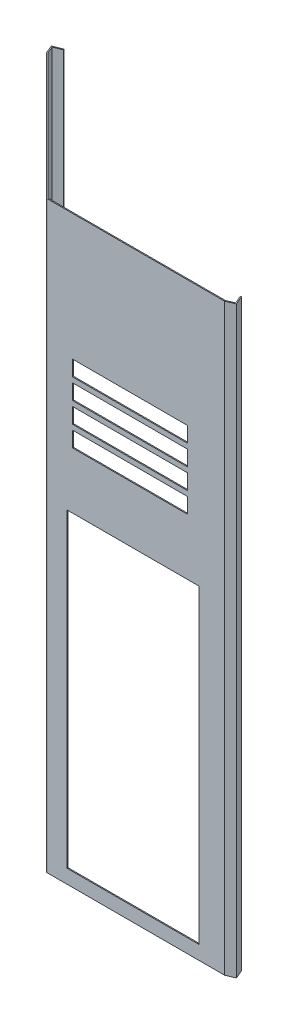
ISO-10303-21;
HEADER;
FILE_DESCRIPTION(('STEP AP214'),'2;1');
FILE_NAME('part.step','',(''),(''),'','','');
FILE_SCHEMA(('AUTOMOTIVE_DESIGN { 1 0 10303 214 1 1 1 1 }'));
ENDSEC;
DATA;
#1=APPLICATION_CONTEXT('core data for automotive mechanical design processes');
#2=APPLICATION_PROTOCOL_DEFINITION('international standard','automotive_design',2000,#1);
#3=PRODUCT_CONTEXT('',#1,'mechanical');
#4=PRODUCT('Part','Part','',(#3));
#5=PRODUCT_RELATED_PRODUCT_CATEGORY('part','',(#4));
#6=PRODUCT_DEFINITION_FORMATION('','',#4);
#7=PRODUCT_DEFINITION_CONTEXT('part definition',#1,'design');
#8=PRODUCT_DEFINITION('design','',#6,#7);
#9=PRODUCT_DEFINITION_SHAPE('','',#8);
#10=(LENGTH_UNIT() NAMED_UNIT(*) SI_UNIT(.MILLI.,.METRE.));
#11=(NAMED_UNIT(*) PLANE_ANGLE_UNIT() SI_UNIT($,.RADIAN.));
#12=(NAMED_UNIT(*) SI_UNIT($,.STERADIAN.) SOLID_ANGLE_UNIT());
#13=UNCERTAINTY_MEASURE_WITH_UNIT(LENGTH_MEASURE(1.E-05),#10,'distance_accuracy_value','');
#14=(GEOMETRIC_REPRESENTATION_CONTEXT(3) GLOBAL_UNCERTAINTY_ASSIGNED_CONTEXT((#13)) GLOBAL_UNIT_ASSIGNED_CONTEXT((#10,
#11,#12)) REPRESENTATION_CONTEXT('',''));
#15=CARTESIAN_POINT('',(0.,0.,0.));
#16=DIRECTION('',(0.,0.,1.));
#17=DIRECTION('',(1.,0.,0.));
#18=AXIS2_PLACEMENT_3D('',#15,#16,#17);
#19=CARTESIAN_POINT('',(-1162.81903084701,0.,-534.416962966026));
#20=DIRECTION('',(0.,-1.,0.));
#21=DIRECTION('',(-1.,0.,0.));
#22=AXIS2_PLACEMENT_3D('',#19,#20,#21);
#23=PLANE('',#22);
#24=DIRECTION('',(0.707106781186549,0.,-0.707106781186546));
#25=VECTOR('',#24,1.);
#26=CARTESIAN_POINT('',(-1006.76914315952,0.,-378.367075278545));
#27=LINE('',#26,#25);
#28=CARTESIAN_POINT('',(-1040.06810921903,0.,-345.068109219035));
#29=VERTEX_POINT('',#28);
#30=CARTESIAN_POINT('',(-1037.23968209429,0.,-347.896536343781));
#31=VERTEX_POINT('',#30);
#32=EDGE_CURVE('E822',#29,#31,#27,.T.);
#33=ORIENTED_EDGE('',*,*,#32,.F.);
#34=DIRECTION('',(-0.707106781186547,0.,-0.707106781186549));
#35=VECTOR('',#34,1.);
#36=CARTESIAN_POINT('',(-695.,0.,0.));
#37=LINE('',#36,#35);
#38=CARTESIAN_POINT('',(-1186.43921292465,0.,-491.439212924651));
#39=VERTEX_POINT('',#38);
#40=EDGE_CURVE('E686',#29,#39,#37,.T.);
#41=ORIENTED_EDGE('',*,*,#40,.T.);
#42=DIRECTION('',(-0.374606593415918,0.,-0.927183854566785));
#43=VECTOR('',#42,1.);
#44=CARTESIAN_POINT('',(-1186.43921292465,0.,-491.439212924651));
#45=LINE('',#44,#43);
#46=CARTESIAN_POINT('',(-1199.55044369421,0.,-523.890647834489));
#47=VERTEX_POINT('',#46);
#48=EDGE_CURVE('E683',#39,#47,#45,.T.);
#49=ORIENTED_EDGE('',*,*,#48,.T.);
#50=DIRECTION('',(0.927183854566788,0.,-0.37460659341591));
#51=VECTOR('',#50,1.);
#52=CARTESIAN_POINT('',(-1199.55044369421,0.,-523.890647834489));
#53=LINE('',#52,#51);
#54=CARTESIAN_POINT('',(-1164.31745722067,0.,-538.125698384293));
#55=VERTEX_POINT('',#54);
#56=EDGE_CURVE('E680',#47,#55,#53,.T.);
#57=ORIENTED_EDGE('',*,*,#56,.T.);
#58=DIRECTION('',(0.374606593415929,0.,0.927183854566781));
#59=VECTOR('',#58,1.);
#60=CARTESIAN_POINT('',(-1164.31745722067,0.,-538.125698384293));
#61=LINE('',#60,#59);
#62=CARTESIAN_POINT('',(-1162.81903084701,0.,-534.416962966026));
#63=VERTEX_POINT('',#62);
#64=EDGE_CURVE('E677',#55,#63,#61,.T.);
#65=ORIENTED_EDGE('',*,*,#64,.T.);
#66=DIRECTION('',(0.927183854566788,0.,-0.37460659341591));
#67=VECTOR('',#66,1.);
#68=CARTESIAN_POINT('',(-1198.05201732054,0.,-520.181912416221));
#69=LINE('',#68,#67);
#70=CARTESIAN_POINT('',(-1194.34328190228,0.,-521.680338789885));
#71=VERTEX_POINT('',#70);
#72=EDGE_CURVE('E630',#71,#63,#69,.T.);
#73=ORIENTED_EDGE('',*,*,#72,.F.);
#74=DIRECTION('',(-0.374606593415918,0.,-0.927183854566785));
#75=VECTOR('',#74,1.);
#76=CARTESIAN_POINT('',(-1182.73047750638,0.,-492.937639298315));
#77=LINE('',#76,#75);
#78=CARTESIAN_POINT('',(-1183.03533579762,0.,-493.692190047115));
#79=VERTEX_POINT('',#78);
#80=EDGE_CURVE('E640',#79,#71,#77,.T.);
#81=ORIENTED_EDGE('',*,*,#80,.F.);
#82=DIRECTION('',(-0.707106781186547,0.,-0.707106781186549));
#83=VECTOR('',#82,1.);
#84=CARTESIAN_POINT('',(-692.171572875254,0.,-2.8284271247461));
#85=LINE('',#84,#83);
#86=EDGE_CURVE('E709',#31,#79,#85,.T.);
#87=ORIENTED_EDGE('',*,*,#86,.F.);
#88=EDGE_LOOP('',(#33,#41,#49,#57,#65,#73,#81,#87));
#89=FACE_BOUND('',#88,.T.);
#90=ADVANCED_FACE('F33',(#89),#23,.T.);
#91=CARTESIAN_POINT('',(-1198.05201732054,2276.,-520.181912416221));
#92=DIRECTION('',(-0.37460659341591,0.,-0.927183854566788));
#93=DIRECTION('',(-0.927183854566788,0.,0.37460659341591));
#94=AXIS2_PLACEMENT_3D('',#91,#92,#93);
#95=PLANE('',#94);
#96=ORIENTED_EDGE('',*,*,#72,.T.);
#97=DIRECTION('',(0.,-1.,0.));
#98=VECTOR('',#97,1.);
#99=CARTESIAN_POINT('',(-1162.81903084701,2276.,-534.416962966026));
#100=LINE('',#99,#98);
#101=CARTESIAN_POINT('',(-1162.81903084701,2276.,-534.416962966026));
#102=VERTEX_POINT('',#101);
#103=EDGE_CURVE('E740',#102,#63,#100,.T.);
#104=ORIENTED_EDGE('',*,*,#103,.F.);
#105=DIRECTION('',(0.927183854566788,0.,-0.37460659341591));
#106=VECTOR('',#105,1.);
#107=CARTESIAN_POINT('',(-1198.05201732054,2276.,-520.181912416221));
#108=LINE('',#107,#106);
#109=CARTESIAN_POINT('',(-1194.34328190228,2276.,-521.680338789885));
#110=VERTEX_POINT('',#109);
#111=EDGE_CURVE('E637',#110,#102,#108,.T.);
#112=ORIENTED_EDGE('',*,*,#111,.F.);
#113=DIRECTION('',(0.,-1.,0.));
#114=VECTOR('',#113,1.);
#115=CARTESIAN_POINT('',(-1194.34328190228,2276.,-521.680338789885));
#116=LINE('',#115,#114);
#117=EDGE_CURVE('E674',#110,#71,#116,.T.);
#118=ORIENTED_EDGE('',*,*,#117,.T.);
#119=EDGE_LOOP('',(#96,#104,#112,#118));
#120=FACE_BOUND('',#119,.T.);
#121=ADVANCED_FACE('F899',(#120),#95,.F.);
#122=CARTESIAN_POINT('',(-1164.31745722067,2276.,-538.125698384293));
#123=DIRECTION('',(0.927183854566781,0.,-0.374606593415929));
#124=DIRECTION('',(-0.374606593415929,0.,-0.927183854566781));
#125=AXIS2_PLACEMENT_3D('',#122,#123,#124);
#126=PLANE('',#125);
#127=ORIENTED_EDGE('',*,*,#64,.F.);
#128=DIRECTION('',(0.,-1.,0.));
#129=VECTOR('',#128,1.);
#130=CARTESIAN_POINT('',(-1164.31745722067,2276.,-538.125698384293));
#131=LINE('',#130,#129);
#132=CARTESIAN_POINT('',(-1164.31745722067,2276.,-538.125698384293));
#133=VERTEX_POINT('',#132);
#134=EDGE_CURVE('E738',#133,#55,#131,.T.);
#135=ORIENTED_EDGE('',*,*,#134,.F.);
#136=DIRECTION('',(0.374606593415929,0.,0.927183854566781));
#137=VECTOR('',#136,1.);
#138=CARTESIAN_POINT('',(-1164.31745722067,2276.,-538.125698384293));
#139=LINE('',#138,#137);
#140=EDGE_CURVE('E639',#133,#102,#139,.T.);
#141=ORIENTED_EDGE('',*,*,#140,.T.);
#142=ORIENTED_EDGE('',*,*,#103,.T.);
#143=EDGE_LOOP('',(#127,#135,#141,#142));
#144=FACE_BOUND('',#143,.T.);
#145=ADVANCED_FACE('F906',(#144),#126,.T.);
#146=CARTESIAN_POINT('',(-1199.55044369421,2276.,-523.890647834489));
#147=DIRECTION('',(-0.37460659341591,0.,-0.927183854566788));
#148=DIRECTION('',(-0.927183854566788,0.,0.37460659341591));
#149=AXIS2_PLACEMENT_3D('',#146,#147,#148);
#150=PLANE('',#149);
#151=ORIENTED_EDGE('',*,*,#56,.F.);
#152=DIRECTION('',(0.,-1.,0.));
#153=VECTOR('',#152,1.);
#154=CARTESIAN_POINT('',(-1199.55044369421,2276.,-523.890647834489));
#155=LINE('',#154,#153);
#156=CARTESIAN_POINT('',(-1199.55044369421,2276.,-523.890647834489));
#157=VERTEX_POINT('',#156);
#158=EDGE_CURVE('E736',#157,#47,#155,.T.);
#159=ORIENTED_EDGE('',*,*,#158,.F.);
#160=DIRECTION('',(0.927183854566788,0.,-0.37460659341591));
#161=VECTOR('',#160,1.);
#162=CARTESIAN_POINT('',(-1199.55044369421,2276.,-523.890647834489));
#163=LINE('',#162,#161);
#164=EDGE_CURVE('E643',#157,#133,#163,.T.);
#165=ORIENTED_EDGE('',*,*,#164,.T.);
#166=ORIENTED_EDGE('',*,*,#134,.T.);
#167=EDGE_LOOP('',(#151,#159,#165,#166));
#168=FACE_BOUND('',#167,.T.);
#169=ADVANCED_FACE('F1011',(#168),#150,.T.);
#170=CARTESIAN_POINT('',(-1186.43921292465,2276.,-491.439212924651));
#171=DIRECTION('',(-0.927183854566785,0.,0.374606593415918));
#172=DIRECTION('',(0.374606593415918,0.,0.927183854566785));
#173=AXIS2_PLACEMENT_3D('',#170,#171,#172);
#174=PLANE('',#173);
#175=ORIENTED_EDGE('',*,*,#48,.F.);
#176=DIRECTION('',(0.,-1.,0.));
#177=VECTOR('',#176,1.);
#178=CARTESIAN_POINT('',(-1186.43921292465,2276.,-491.439212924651));
#179=LINE('',#178,#177);
#180=CARTESIAN_POINT('',(-1186.43921292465,2276.,-491.439212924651));
#181=VERTEX_POINT('',#180);
#182=EDGE_CURVE('E733',#181,#39,#179,.T.);
#183=ORIENTED_EDGE('',*,*,#182,.F.);
#184=DIRECTION('',(-0.374606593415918,0.,-0.927183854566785));
#185=VECTOR('',#184,1.);
#186=CARTESIAN_POINT('',(-1186.43921292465,2276.,-491.439212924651));
#187=LINE('',#186,#185);
#188=EDGE_CURVE('E646',#181,#157,#187,.T.);
#189=ORIENTED_EDGE('',*,*,#188,.T.);
#190=ORIENTED_EDGE('',*,*,#158,.T.);
#191=EDGE_LOOP('',(#175,#183,#189,#190));
#192=FACE_BOUND('',#191,.T.);
#193=ADVANCED_FACE('F1008',(#192),#174,.T.);
#194=CARTESIAN_POINT('',(-695.,2276.,0.));
#195=DIRECTION('',(-0.707106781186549,0.,0.707106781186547));
#196=DIRECTION('',(0.707106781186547,0.,0.707106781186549));
#197=AXIS2_PLACEMENT_3D('',#194,#195,#196);
#198=PLANE('',#197);
#199=DIRECTION('',(0.,-1.,0.));
#200=VECTOR('',#199,1.);
#201=CARTESIAN_POINT('',(-1084.61583643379,1264.,-389.615836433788));
#202=LINE('',#201,#200);
#203=CARTESIAN_POINT('',(-1084.61583643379,1264.,-389.615836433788));
#204=VERTEX_POINT('',#203);
#205=CARTESIAN_POINT('',(-1084.61583643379,1204.,-389.615836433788));
#206=VERTEX_POINT('',#205);
#207=EDGE_CURVE('E48',#204,#206,#202,.T.);
#208=ORIENTED_EDGE('',*,*,#207,.F.);
#209=DIRECTION('',(-0.707106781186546,0.,-0.707106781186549));
#210=VECTOR('',#209,1.);
#211=CARTESIAN_POINT('',(-1084.61583643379,1264.,-389.615836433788));
#212=LINE('',#211,#210);
#213=CARTESIAN_POINT('',(-766.417784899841,1264.,-71.4177848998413));
#214=VERTEX_POINT('',#213);
#215=EDGE_CURVE('E429',#214,#204,#212,.T.);
#216=ORIENTED_EDGE('',*,*,#215,.F.);
#217=DIRECTION('',(0.,1.,0.));
#218=VECTOR('',#217,1.);
#219=CARTESIAN_POINT('',(-766.417784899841,1264.,-71.4177848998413));
#220=LINE('',#219,#218);
#221=CARTESIAN_POINT('',(-766.417784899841,1204.,-71.4177848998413));
#222=VERTEX_POINT('',#221);
#223=EDGE_CURVE('E413',#222,#214,#220,.T.);
#224=ORIENTED_EDGE('',*,*,#223,.F.);
#225=DIRECTION('',(0.707106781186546,0.,0.707106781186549));
#226=VECTOR('',#225,1.);
#227=CARTESIAN_POINT('',(-1084.61583643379,1204.,-389.615836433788));
#228=LINE('',#227,#226);
#229=EDGE_CURVE('E422',#206,#222,#228,.T.);
#230=ORIENTED_EDGE('',*,*,#229,.F.);
#231=EDGE_LOOP('',(#208,#216,#224,#230));
#232=FACE_BOUND('',#231,.T.);
#233=DIRECTION('',(0.,-1.,0.));
#234=VECTOR('',#233,1.);
#235=CARTESIAN_POINT('',(-1084.61583643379,1344.,-389.615836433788));
#236=LINE('',#235,#234);
#237=CARTESIAN_POINT('',(-1084.61583643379,1344.,-389.615836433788));
#238=VERTEX_POINT('',#237);
#239=CARTESIAN_POINT('',(-1084.61583643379,1284.,-389.615836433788));
#240=VERTEX_POINT('',#239);
#241=EDGE_CURVE('E436',#238,#240,#236,.T.);
#242=ORIENTED_EDGE('',*,*,#241,.F.);
#243=DIRECTION('',(-0.707106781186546,0.,-0.707106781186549));
#244=VECTOR('',#243,1.);
#245=CARTESIAN_POINT('',(-1084.61583643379,1344.,-389.615836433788));
#246=LINE('',#245,#244);
#247=CARTESIAN_POINT('',(-766.417784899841,1344.,-71.4177848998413));
#248=VERTEX_POINT('',#247);
#249=EDGE_CURVE('E446',#248,#238,#246,.T.);
#250=ORIENTED_EDGE('',*,*,#249,.F.);
#251=DIRECTION('',(0.,1.,0.));
#252=VECTOR('',#251,1.);
#253=CARTESIAN_POINT('',(-766.417784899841,1344.,-71.4177848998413));
#254=LINE('',#253,#252);
#255=CARTESIAN_POINT('',(-766.417784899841,1284.,-71.4177848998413));
#256=VERTEX_POINT('',#255);
#257=EDGE_CURVE('E443',#256,#248,#254,.T.);
#258=ORIENTED_EDGE('',*,*,#257,.F.);
#259=DIRECTION('',(0.707106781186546,0.,0.707106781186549));
#260=VECTOR('',#259,1.);
#261=CARTESIAN_POINT('',(-1084.61583643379,1284.,-389.615836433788));
#262=LINE('',#261,#260);
#263=EDGE_CURVE('E440',#240,#256,#262,.T.);
#264=ORIENTED_EDGE('',*,*,#263,.F.);
#265=EDGE_LOOP('',(#242,#250,#258,#264));
#266=FACE_BOUND('',#265,.T.);
#267=DIRECTION('',(0.,-1.,0.));
#268=VECTOR('',#267,1.);
#269=CARTESIAN_POINT('',(-1084.61583643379,1424.,-389.615836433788));
#270=LINE('',#269,#268);
#271=CARTESIAN_POINT('',(-1084.61583643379,1424.,-389.615836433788));
#272=VERTEX_POINT('',#271);
#273=CARTESIAN_POINT('',(-1084.61583643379,1364.,-389.615836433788));
#274=VERTEX_POINT('',#273);
#275=EDGE_CURVE('E452',#272,#274,#270,.T.);
#276=ORIENTED_EDGE('',*,*,#275,.F.);
#277=DIRECTION('',(-0.707106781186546,0.,-0.707106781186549));
#278=VECTOR('',#277,1.);
#279=CARTESIAN_POINT('',(-1084.61583643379,1424.,-389.615836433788));
#280=LINE('',#279,#278);
#281=CARTESIAN_POINT('',(-766.417784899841,1424.,-71.4177848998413));
#282=VERTEX_POINT('',#281);
#283=EDGE_CURVE('E466',#282,#272,#280,.T.);
#284=ORIENTED_EDGE('',*,*,#283,.F.);
#285=DIRECTION('',(0.,1.,0.));
#286=VECTOR('',#285,1.);
#287=CARTESIAN_POINT('',(-766.417784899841,1424.,-71.4177848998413));
#288=LINE('',#287,#286);
#289=CARTESIAN_POINT('',(-766.417784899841,1364.,-71.4177848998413));
#290=VERTEX_POINT('',#289);
#291=EDGE_CURVE('E463',#290,#282,#288,.T.);
#292=ORIENTED_EDGE('',*,*,#291,.F.);
#293=DIRECTION('',(0.707106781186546,0.,0.707106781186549));
#294=VECTOR('',#293,1.);
#295=CARTESIAN_POINT('',(-1084.61583643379,1364.,-389.615836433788));
#296=LINE('',#295,#294);
#297=EDGE_CURVE('E460',#274,#290,#296,.T.);
#298=ORIENTED_EDGE('',*,*,#297,.F.);
#299=EDGE_LOOP('',(#276,#284,#292,#298));
#300=FACE_BOUND('',#299,.T.);
#301=DIRECTION('',(0.,-1.,0.));
#302=VECTOR('',#301,1.);
#303=CARTESIAN_POINT('',(-1084.61583643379,1504.,-389.615836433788));
#304=LINE('',#303,#302);
#305=CARTESIAN_POINT('',(-1084.61583643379,1504.,-389.615836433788));
#306=VERTEX_POINT('',#305);
#307=CARTESIAN_POINT('',(-1084.61583643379,1444.,-389.615836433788));
#308=VERTEX_POINT('',#307);
#309=EDGE_CURVE('E472',#306,#308,#304,.T.);
#310=ORIENTED_EDGE('',*,*,#309,.F.);
#311=DIRECTION('',(-0.707106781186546,0.,-0.707106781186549));
#312=VECTOR('',#311,1.);
#313=CARTESIAN_POINT('',(-1084.61583643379,1504.,-389.615836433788));
#314=LINE('',#313,#312);
#315=CARTESIAN_POINT('',(-766.417784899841,1504.,-71.4177848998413));
#316=VERTEX_POINT('',#315);
#317=EDGE_CURVE('E486',#316,#306,#314,.T.);
#318=ORIENTED_EDGE('',*,*,#317,.F.);
#319=DIRECTION('',(0.,1.,0.));
#320=VECTOR('',#319,1.);
#321=CARTESIAN_POINT('',(-766.417784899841,1504.,-71.4177848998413));
#322=LINE('',#321,#320);
#323=CARTESIAN_POINT('',(-766.417784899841,1444.,-71.4177848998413));
#324=VERTEX_POINT('',#323);
#325=EDGE_CURVE('E483',#324,#316,#322,.T.);
#326=ORIENTED_EDGE('',*,*,#325,.F.);
#327=DIRECTION('',(0.707106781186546,0.,0.707106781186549));
#328=VECTOR('',#327,1.);
#329=CARTESIAN_POINT('',(-1084.61583643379,1444.,-389.615836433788));
#330=LINE('',#329,#328);
#331=EDGE_CURVE('E480',#308,#324,#330,.T.);
#332=ORIENTED_EDGE('',*,*,#331,.F.);
#333=EDGE_LOOP('',(#310,#318,#326,#332));
#334=FACE_BOUND('',#333,.T.);
#335=DIRECTION('',(0.,-1.,0.));
#336=VECTOR('',#335,1.);
#337=CARTESIAN_POINT('',(-1084.61583643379,1584.,-389.615836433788));
#338=LINE('',#337,#336);
#339=CARTESIAN_POINT('',(-1084.61583643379,1584.,-389.615836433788));
#340=VERTEX_POINT('',#339);
#341=CARTESIAN_POINT('',(-1084.61583643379,1524.,-389.615836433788));
#342=VERTEX_POINT('',#341);
#343=EDGE_CURVE('E492',#340,#342,#338,.T.);
#344=ORIENTED_EDGE('',*,*,#343,.F.);
#345=DIRECTION('',(-0.707106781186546,0.,-0.707106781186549));
#346=VECTOR('',#345,1.);
#347=CARTESIAN_POINT('',(-1084.61583643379,1584.,-389.615836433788));
#348=LINE('',#347,#346);
#349=CARTESIAN_POINT('',(-766.417784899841,1584.,-71.4177848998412));
#350=VERTEX_POINT('',#349);
#351=EDGE_CURVE('E506',#350,#340,#348,.T.);
#352=ORIENTED_EDGE('',*,*,#351,.F.);
#353=DIRECTION('',(0.,1.,0.));
#354=VECTOR('',#353,1.);
#355=CARTESIAN_POINT('',(-766.417784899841,1584.,-71.4177848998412));
#356=LINE('',#355,#354);
#357=CARTESIAN_POINT('',(-766.417784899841,1524.,-71.4177848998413));
#358=VERTEX_POINT('',#357);
#359=EDGE_CURVE('E503',#358,#350,#356,.T.);
#360=ORIENTED_EDGE('',*,*,#359,.F.);
#361=DIRECTION('',(0.707106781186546,0.,0.707106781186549));
#362=VECTOR('',#361,1.);
#363=CARTESIAN_POINT('',(-1084.61583643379,1524.,-389.615836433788));
#364=LINE('',#363,#362);
#365=EDGE_CURVE('E500',#342,#358,#364,.T.);
#366=ORIENTED_EDGE('',*,*,#365,.F.);
#367=EDGE_LOOP('',(#344,#352,#360,#366));
#368=FACE_BOUND('',#367,.T.);
#369=DIRECTION('',(0.,-1.,0.));
#370=VECTOR('',#369,1.);
#371=CARTESIAN_POINT('',(-1040.06810921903,0.,-345.068109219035));
#372=LINE('',#371,#370);
#373=CARTESIAN_POINT('',(-1040.06810921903,665.,-345.068109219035));
#374=VERTEX_POINT('',#373);
#375=EDGE_CURVE('E512',#374,#29,#372,.T.);
#376=ORIENTED_EDGE('',*,*,#375,.F.);
#377=DIRECTION('',(-0.707106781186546,0.,-0.707106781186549));
#378=VECTOR('',#377,1.);
#379=CARTESIAN_POINT('',(-1040.06810921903,665.,-345.068109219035));
#380=LINE('',#379,#378);
#381=CARTESIAN_POINT('',(-736.01219330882,665.,-41.0121933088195));
#382=VERTEX_POINT('',#381);
#383=EDGE_CURVE('E523',#382,#374,#380,.T.);
#384=ORIENTED_EDGE('',*,*,#383,.F.);
#385=DIRECTION('',(0.,1.,0.));
#386=VECTOR('',#385,1.);
#387=CARTESIAN_POINT('',(-736.01219330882,0.,-41.0121933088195));
#388=LINE('',#387,#386);
#389=CARTESIAN_POINT('',(-736.01219330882,0.,-41.0121933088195));
#390=VERTEX_POINT('',#389);
#391=EDGE_CURVE('E520',#390,#382,#388,.T.);
#392=ORIENTED_EDGE('',*,*,#391,.F.);
#393=CARTESIAN_POINT('',(-696.171572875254,0.,-1.17157287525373));
#394=VERTEX_POINT('',#393);
#395=EDGE_CURVE('E687',#394,#390,#37,.T.);
#396=ORIENTED_EDGE('',*,*,#395,.F.);
#397=DIRECTION('',(0.,-1.,0.));
#398=VECTOR('',#397,1.);
#399=CARTESIAN_POINT('',(-696.171572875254,2276.,-1.17157287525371));
#400=LINE('',#399,#398);
#401=CARTESIAN_POINT('',(-696.171572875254,2276.,-1.17157287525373));
#402=VERTEX_POINT('',#401);
#403=EDGE_CURVE('E747',#394,#402,#400,.F.);
#404=ORIENTED_EDGE('',*,*,#403,.T.);
#405=DIRECTION('',(-0.707106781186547,0.,-0.707106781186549));
#406=VECTOR('',#405,1.);
#407=CARTESIAN_POINT('',(-695.,2276.,0.));
#408=LINE('',#407,#406);
#409=EDGE_CURVE('E649',#402,#181,#408,.T.);
#410=ORIENTED_EDGE('',*,*,#409,.T.);
#411=ORIENTED_EDGE('',*,*,#182,.T.);
#412=ORIENTED_EDGE('',*,*,#40,.F.);
#413=EDGE_LOOP('',(#376,#384,#392,#396,#404,#410,#411,#412));
#414=FACE_BOUND('',#413,.T.);
#415=ADVANCED_FACE('F426',(#232,#266,#300,#334,#368,#414),#198,.T.);
#416=CARTESIAN_POINT('',(0.,2276.,0.));
#417=DIRECTION('',(0.,0.,1.));
#418=DIRECTION('',(1.,0.,0.));
#419=AXIS2_PLACEMENT_3D('',#416,#417,#418);
#420=PLANE('',#419);
#421=DIRECTION('',(0.,-1.,0.));
#422=VECTOR('',#421,1.);
#423=CARTESIAN_POINT('',(-594.,1624.,0.));
#424=LINE('',#423,#422);
#425=CARTESIAN_POINT('',(-594.,1624.,0.));
#426=VERTEX_POINT('',#425);
#427=CARTESIAN_POINT('',(-594.,1564.,0.));
#428=VERTEX_POINT('',#427);
#429=EDGE_CURVE('E536',#426,#428,#424,.T.);
#430=ORIENTED_EDGE('',*,*,#429,.F.);
#431=DIRECTION('',(-1.,0.,0.));
#432=VECTOR('',#431,1.);
#433=CARTESIAN_POINT('',(-594.,1624.,0.));
#434=LINE('',#433,#432);
#435=CARTESIAN_POINT('',(-144.,1624.,0.));
#436=VERTEX_POINT('',#435);
#437=EDGE_CURVE('E544',#436,#426,#434,.T.);
#438=ORIENTED_EDGE('',*,*,#437,.F.);
#439=DIRECTION('',(0.,1.,0.));
#440=VECTOR('',#439,1.);
#441=CARTESIAN_POINT('',(-144.,1624.,0.));
#442=LINE('',#441,#440);
#443=CARTESIAN_POINT('',(-144.,1564.,0.));
#444=VERTEX_POINT('',#443);
#445=EDGE_CURVE('E541',#444,#436,#442,.T.);
#446=ORIENTED_EDGE('',*,*,#445,.F.);
#447=DIRECTION('',(1.,0.,0.));
#448=VECTOR('',#447,1.);
#449=CARTESIAN_POINT('',(-594.,1564.,0.));
#450=LINE('',#449,#448);
#451=EDGE_CURVE('E538',#428,#444,#450,.T.);
#452=ORIENTED_EDGE('',*,*,#451,.F.);
#453=EDGE_LOOP('',(#430,#438,#446,#452));
#454=FACE_BOUND('',#453,.T.);
#455=DIRECTION('',(0.,-1.,0.));
#456=VECTOR('',#455,1.);
#457=CARTESIAN_POINT('',(-594.,1704.,0.));
#458=LINE('',#457,#456);
#459=CARTESIAN_POINT('',(-594.,1704.,0.));
#460=VERTEX_POINT('',#459);
#461=CARTESIAN_POINT('',(-594.,1644.,0.));
#462=VERTEX_POINT('',#461);
#463=EDGE_CURVE('E550',#460,#462,#458,.T.);
#464=ORIENTED_EDGE('',*,*,#463,.F.);
#465=DIRECTION('',(-1.,0.,0.));
#466=VECTOR('',#465,1.);
#467=CARTESIAN_POINT('',(-594.,1704.,0.));
#468=LINE('',#467,#466);
#469=CARTESIAN_POINT('',(-144.,1704.,0.));
#470=VERTEX_POINT('',#469);
#471=EDGE_CURVE('E564',#470,#460,#468,.T.);
#472=ORIENTED_EDGE('',*,*,#471,.F.);
#473=DIRECTION('',(0.,1.,0.));
#474=VECTOR('',#473,1.);
#475=CARTESIAN_POINT('',(-144.,1704.,0.));
#476=LINE('',#475,#474);
#477=CARTESIAN_POINT('',(-144.,1644.,0.));
#478=VERTEX_POINT('',#477);
#479=EDGE_CURVE('E561',#478,#470,#476,.T.);
#480=ORIENTED_EDGE('',*,*,#479,.F.);
#481=DIRECTION('',(1.,0.,0.));
#482=VECTOR('',#481,1.);
#483=CARTESIAN_POINT('',(-594.,1644.,0.));
#484=LINE('',#483,#482);
#485=EDGE_CURVE('E558',#462,#478,#484,.T.);
#486=ORIENTED_EDGE('',*,*,#485,.F.);
#487=EDGE_LOOP('',(#464,#472,#480,#486));
#488=FACE_BOUND('',#487,.T.);
#489=DIRECTION('',(0.,-1.,0.));
#490=VECTOR('',#489,1.);
#491=CARTESIAN_POINT('',(-594.,1544.,0.));
#492=LINE('',#491,#490);
#493=CARTESIAN_POINT('',(-594.,1544.,0.));
#494=VERTEX_POINT('',#493);
#495=CARTESIAN_POINT('',(-594.,1484.,0.));
#496=VERTEX_POINT('',#495);
#497=EDGE_CURVE('E570',#494,#496,#492,.T.);
#498=ORIENTED_EDGE('',*,*,#497,.F.);
#499=DIRECTION('',(-1.,0.,0.));
#500=VECTOR('',#499,1.);
#501=CARTESIAN_POINT('',(-594.,1544.,0.));
#502=LINE('',#501,#500);
#503=CARTESIAN_POINT('',(-144.,1544.,0.));
#504=VERTEX_POINT('',#503);
#505=EDGE_CURVE('E584',#504,#494,#502,.T.);
#506=ORIENTED_EDGE('',*,*,#505,.F.);
#507=DIRECTION('',(0.,1.,0.));
#508=VECTOR('',#507,1.);
#509=CARTESIAN_POINT('',(-144.,1544.,0.));
#510=LINE('',#509,#508);
#511=CARTESIAN_POINT('',(-144.,1484.,0.));
#512=VERTEX_POINT('',#511);
#513=EDGE_CURVE('E581',#512,#504,#510,.T.);
#514=ORIENTED_EDGE('',*,*,#513,.F.);
#515=DIRECTION('',(1.,0.,0.));
#516=VECTOR('',#515,1.);
#517=CARTESIAN_POINT('',(-594.,1484.,0.));
#518=LINE('',#517,#516);
#519=EDGE_CURVE('E578',#496,#512,#518,.T.);
#520=ORIENTED_EDGE('',*,*,#519,.F.);
#521=EDGE_LOOP('',(#498,#506,#514,#520));
#522=FACE_BOUND('',#521,.T.);
#523=DIRECTION('',(0.,-1.,0.));
#524=VECTOR('',#523,1.);
#525=CARTESIAN_POINT('',(-594.,1784.,0.));
#526=LINE('',#525,#524);
#527=CARTESIAN_POINT('',(-594.,1784.,0.));
#528=VERTEX_POINT('',#527);
#529=CARTESIAN_POINT('',(-594.,1724.,0.));
#530=VERTEX_POINT('',#529);
#531=EDGE_CURVE('E590',#528,#530,#526,.T.);
#532=ORIENTED_EDGE('',*,*,#531,.F.);
#533=DIRECTION('',(-1.,0.,0.));
#534=VECTOR('',#533,1.);
#535=CARTESIAN_POINT('',(-594.,1784.,0.));
#536=LINE('',#535,#534);
#537=CARTESIAN_POINT('',(-144.,1784.,0.));
#538=VERTEX_POINT('',#537);
#539=EDGE_CURVE('E604',#538,#528,#536,.T.);
#540=ORIENTED_EDGE('',*,*,#539,.F.);
#541=DIRECTION('',(0.,1.,0.));
#542=VECTOR('',#541,1.);
#543=CARTESIAN_POINT('',(-144.,1784.,0.));
#544=LINE('',#543,#542);
#545=CARTESIAN_POINT('',(-144.,1724.,0.));
#546=VERTEX_POINT('',#545);
#547=EDGE_CURVE('E601',#546,#538,#544,.T.);
#548=ORIENTED_EDGE('',*,*,#547,.F.);
#549=DIRECTION('',(1.,0.,0.));
#550=VECTOR('',#549,1.);
#551=CARTESIAN_POINT('',(-594.,1724.,0.));
#552=LINE('',#551,#550);
#553=EDGE_CURVE('E598',#530,#546,#552,.T.);
#554=ORIENTED_EDGE('',*,*,#553,.F.);
#555=EDGE_LOOP('',(#532,#540,#548,#554));
#556=FACE_BOUND('',#555,.T.);
#557=DIRECTION('',(0.,-1.,0.));
#558=VECTOR('',#557,1.);
#559=CARTESIAN_POINT('',(-614.,1264.,0.));
#560=LINE('',#559,#558);
#561=CARTESIAN_POINT('',(-614.,1264.,0.));
#562=VERTEX_POINT('',#561);
#563=CARTESIAN_POINT('',(-614.,54.0000000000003,0.));
#564=VERTEX_POINT('',#563);
#565=EDGE_CURVE('E610',#562,#564,#560,.T.);
#566=ORIENTED_EDGE('',*,*,#565,.F.);
#567=DIRECTION('',(-1.,0.,0.));
#568=VECTOR('',#567,1.);
#569=CARTESIAN_POINT('',(-614.,1264.,0.));
#570=LINE('',#569,#568);
#571=CARTESIAN_POINT('',(-100.,1264.,0.));
#572=VERTEX_POINT('',#571);
#573=EDGE_CURVE('E624',#572,#562,#570,.T.);
#574=ORIENTED_EDGE('',*,*,#573,.F.);
#575=DIRECTION('',(0.,1.,0.));
#576=VECTOR('',#575,1.);
#577=CARTESIAN_POINT('',(-100.,1264.,0.));
#578=LINE('',#577,#576);
#579=CARTESIAN_POINT('',(-99.9999999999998,54.,0.));
#580=VERTEX_POINT('',#579);
#581=EDGE_CURVE('E621',#580,#572,#578,.T.);
#582=ORIENTED_EDGE('',*,*,#581,.F.);
#583=DIRECTION('',(1.,0.,0.));
#584=VECTOR('',#583,1.);
#585=CARTESIAN_POINT('',(-614.,54.,0.));
#586=LINE('',#585,#584);
#587=EDGE_CURVE('E618',#564,#580,#586,.T.);
#588=ORIENTED_EDGE('',*,*,#587,.F.);
#589=EDGE_LOOP('',(#566,#574,#582,#588));
#590=FACE_BOUND('',#589,.T.);
#591=DIRECTION('',(-1.,0.,0.));
#592=VECTOR('',#591,1.);
#593=CARTESIAN_POINT('',(0.,2276.,0.));
#594=LINE('',#593,#592);
#595=CARTESIAN_POINT('',(0.,2276.,0.));
#596=VERTEX_POINT('',#595);
#597=CARTESIAN_POINT('',(-693.343145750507,2276.,0.));
#598=VERTEX_POINT('',#597);
#599=EDGE_CURVE('E651',#596,#598,#594,.T.);
#600=ORIENTED_EDGE('',*,*,#599,.T.);
#601=DIRECTION('',(0.,-1.,0.));
#602=VECTOR('',#601,1.);
#603=CARTESIAN_POINT('',(-693.343145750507,2276.,0.));
#604=LINE('',#603,#602);
#605=CARTESIAN_POINT('',(-693.343145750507,0.,0.));
#606=VERTEX_POINT('',#605);
#607=EDGE_CURVE('E742',#598,#606,#604,.T.);
#608=ORIENTED_EDGE('',*,*,#607,.T.);
#609=DIRECTION('',(-1.,0.,0.));
#610=VECTOR('',#609,1.);
#611=CARTESIAN_POINT('',(0.,0.,0.));
#612=LINE('',#611,#610);
#613=CARTESIAN_POINT('',(0.,0.,0.));
#614=VERTEX_POINT('',#613);
#615=EDGE_CURVE('E690',#614,#606,#612,.T.);
#616=ORIENTED_EDGE('',*,*,#615,.F.);
#617=DIRECTION('',(0.,-1.,0.));
#618=VECTOR('',#617,1.);
#619=CARTESIAN_POINT('',(0.,2276.,0.));
#620=LINE('',#619,#618);
#621=EDGE_CURVE('E731',#596,#614,#620,.T.);
#622=ORIENTED_EDGE('',*,*,#621,.F.);
#623=EDGE_LOOP('',(#600,#608,#616,#622));
#624=FACE_BOUND('',#623,.T.);
#625=ADVANCED_FACE('F963',(#454,#488,#522,#556,#590,#624),#420,.T.);
#626=CARTESIAN_POINT('',(0.,2276.,0.));
#627=DIRECTION('',(0.390731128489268,0.,0.920504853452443));
#628=DIRECTION('',(0.920504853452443,0.,-0.390731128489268));
#629=AXIS2_PLACEMENT_3D('',#626,#627,#628);
#630=PLANE('',#629);
#631=DIRECTION('',(-0.920504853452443,0.,0.390731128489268));
#632=VECTOR('',#631,1.);
#633=CARTESIAN_POINT('',(0.,0.,0.));
#634=LINE('',#633,#632);
#635=CARTESIAN_POINT('',(32.2176698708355,0.,-13.6755894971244));
#636=VERTEX_POINT('',#635);
#637=EDGE_CURVE('E693',#636,#614,#634,.T.);
#638=ORIENTED_EDGE('',*,*,#637,.F.);
#639=DIRECTION('',(0.,-1.,0.));
#640=VECTOR('',#639,1.);
#641=CARTESIAN_POINT('',(32.2176698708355,2276.,-13.6755894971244));
#642=LINE('',#641,#640);
#643=CARTESIAN_POINT('',(32.2176698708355,2276.,-13.6755894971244));
#644=VERTEX_POINT('',#643);
#645=EDGE_CURVE('E729',#644,#636,#642,.T.);
#646=ORIENTED_EDGE('',*,*,#645,.F.);
#647=DIRECTION('',(-0.920504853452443,0.,0.390731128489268));
#648=VECTOR('',#647,1.);
#649=CARTESIAN_POINT('',(0.,2276.,0.));
#650=LINE('',#649,#648);
#651=EDGE_CURVE('E654',#644,#596,#650,.T.);
#652=ORIENTED_EDGE('',*,*,#651,.T.);
#653=ORIENTED_EDGE('',*,*,#621,.T.);
#654=EDGE_LOOP('',(#638,#646,#652,#653));
#655=FACE_BOUND('',#654,.T.);
#656=ADVANCED_FACE('F959',(#655),#630,.T.);
#657=CARTESIAN_POINT('',(32.2176698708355,2276.,-13.6755894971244));
#658=DIRECTION('',(0.920504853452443,0.,-0.390731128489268));
#659=DIRECTION('',(-0.390731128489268,0.,-0.920504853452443));
#660=AXIS2_PLACEMENT_3D('',#657,#658,#659);
#661=PLANE('',#660);
#662=DIRECTION('',(0.390731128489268,0.,0.920504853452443));
#663=VECTOR('',#662,1.);
#664=CARTESIAN_POINT('',(32.2176698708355,0.,-13.6755894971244));
#665=LINE('',#664,#663);
#666=CARTESIAN_POINT('',(17.3698869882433,0.,-48.6547739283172));
#667=VERTEX_POINT('',#666);
#668=EDGE_CURVE('E696',#667,#636,#665,.T.);
#669=ORIENTED_EDGE('',*,*,#668,.F.);
#670=DIRECTION('',(0.,-1.,0.));
#671=VECTOR('',#670,1.);
#672=CARTESIAN_POINT('',(17.3698869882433,2276.,-48.6547739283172));
#673=LINE('',#672,#671);
#674=CARTESIAN_POINT('',(17.3698869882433,2276.,-48.6547739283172));
#675=VERTEX_POINT('',#674);
#676=EDGE_CURVE('E727',#675,#667,#673,.T.);
#677=ORIENTED_EDGE('',*,*,#676,.F.);
#678=DIRECTION('',(0.390731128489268,0.,0.920504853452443));
#679=VECTOR('',#678,1.);
#680=CARTESIAN_POINT('',(32.2176698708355,2276.,-13.6755894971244));
#681=LINE('',#680,#679);
#682=EDGE_CURVE('E657',#675,#644,#681,.T.);
#683=ORIENTED_EDGE('',*,*,#682,.T.);
#684=ORIENTED_EDGE('',*,*,#645,.T.);
#685=EDGE_LOOP('',(#669,#677,#683,#684));
#686=FACE_BOUND('',#685,.T.);
#687=ADVANCED_FACE('F955',(#686),#661,.T.);
#688=CARTESIAN_POINT('',(13.6878675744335,2276.,-47.0918494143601));
#689=DIRECTION('',(-0.390731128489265,0.,-0.920504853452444));
#690=DIRECTION('',(-0.920504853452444,0.,0.390731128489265));
#691=AXIS2_PLACEMENT_3D('',#688,#689,#690);
#692=PLANE('',#691);
#693=DIRECTION('',(0.920504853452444,0.,-0.390731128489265));
#694=VECTOR('',#693,1.);
#695=CARTESIAN_POINT('',(13.6878675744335,0.,-47.0918494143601));
#696=LINE('',#695,#694);
#697=CARTESIAN_POINT('',(13.6878675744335,0.,-47.0918494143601));
#698=VERTEX_POINT('',#697);
#699=EDGE_CURVE('E699',#698,#667,#696,.T.);
#700=ORIENTED_EDGE('',*,*,#699,.F.);
#701=DIRECTION('',(0.,-1.,0.));
#702=VECTOR('',#701,1.);
#703=CARTESIAN_POINT('',(13.6878675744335,2276.,-47.0918494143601));
#704=LINE('',#703,#702);
#705=CARTESIAN_POINT('',(13.6878675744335,2276.,-47.0918494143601));
#706=VERTEX_POINT('',#705);
#707=EDGE_CURVE('E725',#706,#698,#704,.T.);
#708=ORIENTED_EDGE('',*,*,#707,.F.);
#709=DIRECTION('',(0.920504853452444,0.,-0.390731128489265));
#710=VECTOR('',#709,1.);
#711=CARTESIAN_POINT('',(13.6878675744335,2276.,-47.0918494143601));
#712=LINE('',#711,#710);
#713=EDGE_CURVE('E660',#706,#675,#712,.T.);
#714=ORIENTED_EDGE('',*,*,#713,.T.);
#715=ORIENTED_EDGE('',*,*,#676,.T.);
#716=EDGE_LOOP('',(#700,#708,#714,#715));
#717=FACE_BOUND('',#716,.T.);
#718=ADVANCED_FACE('F949',(#717),#692,.T.);
#719=CARTESIAN_POINT('',(28.5356504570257,2276.,-12.1126649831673));
#720=DIRECTION('',(0.920504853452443,0.,-0.390731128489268));
#721=DIRECTION('',(-0.390731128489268,0.,-0.920504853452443));
#722=AXIS2_PLACEMENT_3D('',#719,#720,#721);
#723=PLANE('',#722);
#724=DIRECTION('',(0.390731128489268,0.,0.920504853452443));
#725=VECTOR('',#724,1.);
#726=CARTESIAN_POINT('',(28.5356504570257,0.,-12.1126649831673));
#727=LINE('',#726,#725);
#728=CARTESIAN_POINT('',(26.9727259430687,0.,-15.7946843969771));
#729=VERTEX_POINT('',#728);
#730=EDGE_CURVE('E702',#698,#729,#727,.T.);
#731=ORIENTED_EDGE('',*,*,#730,.T.);
#732=DIRECTION('',(0.,-1.,0.));
#733=VECTOR('',#732,1.);
#734=CARTESIAN_POINT('',(26.9727259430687,2276.,-15.7946843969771));
#735=LINE('',#734,#733);
#736=CARTESIAN_POINT('',(26.9727259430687,2276.,-15.7946843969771));
#737=VERTEX_POINT('',#736);
#738=EDGE_CURVE('E722',#737,#729,#735,.T.);
#739=ORIENTED_EDGE('',*,*,#738,.F.);
#740=DIRECTION('',(0.390731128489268,0.,0.920504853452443));
#741=VECTOR('',#740,1.);
#742=CARTESIAN_POINT('',(28.5356504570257,2276.,-12.1126649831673));
#743=LINE('',#742,#741);
#744=EDGE_CURVE('E663',#706,#737,#743,.T.);
#745=ORIENTED_EDGE('',*,*,#744,.F.);
#746=ORIENTED_EDGE('',*,*,#707,.T.);
#747=EDGE_LOOP('',(#731,#739,#745,#746));
#748=FACE_BOUND('',#747,.T.);
#749=ADVANCED_FACE('F988',(#748),#723,.F.);
#750=CARTESIAN_POINT('',(-1.56292451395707,2276.,-3.68201941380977));
#751=DIRECTION('',(0.390731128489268,0.,0.920504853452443));
#752=DIRECTION('',(0.920504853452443,0.,-0.390731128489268));
#753=AXIS2_PLACEMENT_3D('',#750,#751,#752);
#754=PLANE('',#753);
#755=DIRECTION('',(-0.920504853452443,0.,0.390731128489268));
#756=VECTOR('',#755,1.);
#757=CARTESIAN_POINT('',(-1.56292451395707,0.,-3.68201941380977));
#758=LINE('',#757,#756);
#759=CARTESIAN_POINT('',(-0.813809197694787,0.,-4.));
#760=VERTEX_POINT('',#759);
#761=EDGE_CURVE('E704',#729,#760,#758,.T.);
#762=ORIENTED_EDGE('',*,*,#761,.T.);
#763=DIRECTION('',(0.,-1.,0.));
#764=VECTOR('',#763,1.);
#765=CARTESIAN_POINT('',(-0.813809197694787,2276.,-4.));
#766=LINE('',#765,#764);
#767=CARTESIAN_POINT('',(-0.813809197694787,2276.,-4.));
#768=VERTEX_POINT('',#767);
#769=EDGE_CURVE('E719',#768,#760,#766,.T.);
#770=ORIENTED_EDGE('',*,*,#769,.F.);
#771=DIRECTION('',(-0.920504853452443,0.,0.390731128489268));
#772=VECTOR('',#771,1.);
#773=CARTESIAN_POINT('',(-1.56292451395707,2276.,-3.68201941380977));
#774=LINE('',#773,#772);
#775=EDGE_CURVE('E665',#737,#768,#774,.T.);
#776=ORIENTED_EDGE('',*,*,#775,.F.);
#777=ORIENTED_EDGE('',*,*,#738,.T.);
#778=EDGE_LOOP('',(#762,#770,#776,#777));
#779=FACE_BOUND('',#778,.T.);
#780=ADVANCED_FACE('F943',(#779),#754,.F.);
#781=CARTESIAN_POINT('',(0.,2276.,-4.));
#782=DIRECTION('',(0.,0.,1.));
#783=DIRECTION('',(1.,0.,0.));
#784=AXIS2_PLACEMENT_3D('',#781,#782,#783);
#785=PLANE('',#784);
#786=DIRECTION('',(-1.,0.,0.));
#787=VECTOR('',#786,1.);
#788=CARTESIAN_POINT('',(0.,1624.,-4.));
#789=LINE('',#788,#787);
#790=CARTESIAN_POINT('',(-144.,1624.,-4.));
#791=VERTEX_POINT('',#790);
#792=CARTESIAN_POINT('',(-594.,1624.,-4.));
#793=VERTEX_POINT('',#792);
#794=EDGE_CURVE('E814',#791,#793,#789,.T.);
#795=ORIENTED_EDGE('',*,*,#794,.T.);
#796=DIRECTION('',(0.,-1.,0.));
#797=VECTOR('',#796,1.);
#798=CARTESIAN_POINT('',(-594.,2276.,-3.99999999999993));
#799=LINE('',#798,#797);
#800=CARTESIAN_POINT('',(-594.,1564.,-4.));
#801=VERTEX_POINT('',#800);
#802=EDGE_CURVE('E817',#793,#801,#799,.T.);
#803=ORIENTED_EDGE('',*,*,#802,.T.);
#804=DIRECTION('',(1.,0.,0.));
#805=VECTOR('',#804,1.);
#806=CARTESIAN_POINT('',(0.,1564.,-4.));
#807=LINE('',#806,#805);
#808=CARTESIAN_POINT('',(-144.,1564.,-3.99999999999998));
#809=VERTEX_POINT('',#808);
#810=EDGE_CURVE('E808',#801,#809,#807,.T.);
#811=ORIENTED_EDGE('',*,*,#810,.T.);
#812=DIRECTION('',(0.,1.,0.));
#813=VECTOR('',#812,1.);
#814=CARTESIAN_POINT('',(-144.,2276.,-3.99999999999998));
#815=LINE('',#814,#813);
#816=EDGE_CURVE('E811',#809,#791,#815,.T.);
#817=ORIENTED_EDGE('',*,*,#816,.T.);
#818=EDGE_LOOP('',(#795,#803,#811,#817));
#819=FACE_BOUND('',#818,.T.);
#820=DIRECTION('',(-1.,0.,0.));
#821=VECTOR('',#820,1.);
#822=CARTESIAN_POINT('',(0.,1704.,-4.));
#823=LINE('',#822,#821);
#824=CARTESIAN_POINT('',(-144.,1704.,-4.));
#825=VERTEX_POINT('',#824);
#826=CARTESIAN_POINT('',(-594.,1704.,-4.));
#827=VERTEX_POINT('',#826);
#828=EDGE_CURVE('E802',#825,#827,#823,.T.);
#829=ORIENTED_EDGE('',*,*,#828,.T.);
#830=DIRECTION('',(0.,-1.,0.));
#831=VECTOR('',#830,1.);
#832=CARTESIAN_POINT('',(-594.,2276.,-3.99999999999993));
#833=LINE('',#832,#831);
#834=CARTESIAN_POINT('',(-594.,1644.,-4.));
#835=VERTEX_POINT('',#834);
#836=EDGE_CURVE('E805',#827,#835,#833,.T.);
#837=ORIENTED_EDGE('',*,*,#836,.T.);
#838=DIRECTION('',(1.,0.,0.));
#839=VECTOR('',#838,1.);
#840=CARTESIAN_POINT('',(0.,1644.,-4.));
#841=LINE('',#840,#839);
#842=CARTESIAN_POINT('',(-144.,1644.,-3.99999999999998));
#843=VERTEX_POINT('',#842);
#844=EDGE_CURVE('E796',#835,#843,#841,.T.);
#845=ORIENTED_EDGE('',*,*,#844,.T.);
#846=DIRECTION('',(0.,1.,0.));
#847=VECTOR('',#846,1.);
#848=CARTESIAN_POINT('',(-144.,2276.,-3.99999999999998));
#849=LINE('',#848,#847);
#850=EDGE_CURVE('E799',#843,#825,#849,.T.);
#851=ORIENTED_EDGE('',*,*,#850,.T.);
#852=EDGE_LOOP('',(#829,#837,#845,#851));
#853=FACE_BOUND('',#852,.T.);
#854=DIRECTION('',(-1.,0.,0.));
#855=VECTOR('',#854,1.);
#856=CARTESIAN_POINT('',(0.,1544.,-4.));
#857=LINE('',#856,#855);
#858=CARTESIAN_POINT('',(-144.,1544.,-4.));
#859=VERTEX_POINT('',#858);
#860=CARTESIAN_POINT('',(-594.,1544.,-4.));
#861=VERTEX_POINT('',#860);
#862=EDGE_CURVE('E790',#859,#861,#857,.T.);
#863=ORIENTED_EDGE('',*,*,#862,.T.);
#864=DIRECTION('',(0.,-1.,0.));
#865=VECTOR('',#864,1.);
#866=CARTESIAN_POINT('',(-594.,2276.,-3.99999999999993));
#867=LINE('',#866,#865);
#868=CARTESIAN_POINT('',(-594.,1484.,-4.));
#869=VERTEX_POINT('',#868);
#870=EDGE_CURVE('E793',#861,#869,#867,.T.);
#871=ORIENTED_EDGE('',*,*,#870,.T.);
#872=DIRECTION('',(1.,0.,0.));
#873=VECTOR('',#872,1.);
#874=CARTESIAN_POINT('',(-3.91288363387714E-13,1484.,-4.));
#875=LINE('',#874,#873);
#876=CARTESIAN_POINT('',(-144.,1484.,-3.99999999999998));
#877=VERTEX_POINT('',#876);
#878=EDGE_CURVE('E784',#869,#877,#875,.T.);
#879=ORIENTED_EDGE('',*,*,#878,.T.);
#880=DIRECTION('',(0.,1.,0.));
#881=VECTOR('',#880,1.);
#882=CARTESIAN_POINT('',(-144.,2276.,-3.99999999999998));
#883=LINE('',#882,#881);
#884=EDGE_CURVE('E787',#877,#859,#883,.T.);
#885=ORIENTED_EDGE('',*,*,#884,.T.);
#886=EDGE_LOOP('',(#863,#871,#879,#885));
#887=FACE_BOUND('',#886,.T.);
#888=DIRECTION('',(-1.,0.,0.));
#889=VECTOR('',#888,1.);
#890=CARTESIAN_POINT('',(-2.43258626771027E-13,1784.,-4.));
#891=LINE('',#890,#889);
#892=CARTESIAN_POINT('',(-144.,1784.,-4.));
#893=VERTEX_POINT('',#892);
#894=CARTESIAN_POINT('',(-594.,1784.,-4.));
#895=VERTEX_POINT('',#894);
#896=EDGE_CURVE('E778',#893,#895,#891,.T.);
#897=ORIENTED_EDGE('',*,*,#896,.T.);
#898=DIRECTION('',(0.,-1.,0.));
#899=VECTOR('',#898,1.);
#900=CARTESIAN_POINT('',(-594.000000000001,2276.,-3.99999999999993));
#901=LINE('',#900,#899);
#902=CARTESIAN_POINT('',(-594.,1724.,-4.));
#903=VERTEX_POINT('',#902);
#904=EDGE_CURVE('E781',#895,#903,#901,.T.);
#905=ORIENTED_EDGE('',*,*,#904,.T.);
#906=DIRECTION('',(1.,0.,0.));
#907=VECTOR('',#906,1.);
#908=CARTESIAN_POINT('',(2.71884856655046E-13,1724.,-4.));
#909=LINE('',#908,#907);
#910=CARTESIAN_POINT('',(-144.,1724.,-3.99999999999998));
#911=VERTEX_POINT('',#910);
#912=EDGE_CURVE('E772',#903,#911,#909,.T.);
#913=ORIENTED_EDGE('',*,*,#912,.T.);
#914=DIRECTION('',(0.,1.,0.));
#915=VECTOR('',#914,1.);
#916=CARTESIAN_POINT('',(-144.,2276.,-3.99999999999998));
#917=LINE('',#916,#915);
#918=EDGE_CURVE('E775',#911,#893,#917,.T.);
#919=ORIENTED_EDGE('',*,*,#918,.T.);
#920=EDGE_LOOP('',(#897,#905,#913,#919));
#921=FACE_BOUND('',#920,.T.);
#922=DIRECTION('',(-1.,0.,0.));
#923=VECTOR('',#922,1.);
#924=CARTESIAN_POINT('',(0.,1264.,-4.));
#925=LINE('',#924,#923);
#926=CARTESIAN_POINT('',(-100.,1264.,-4.));
#927=VERTEX_POINT('',#926);
#928=CARTESIAN_POINT('',(-614.,1264.,-4.));
#929=VERTEX_POINT('',#928);
#930=EDGE_CURVE('E766',#927,#929,#925,.T.);
#931=ORIENTED_EDGE('',*,*,#930,.T.);
#932=DIRECTION('',(0.,-1.,0.));
#933=VECTOR('',#932,1.);
#934=CARTESIAN_POINT('',(-614.,2276.,-3.99999999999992));
#935=LINE('',#934,#933);
#936=CARTESIAN_POINT('',(-614.,54.,-4.));
#937=VERTEX_POINT('',#936);
#938=EDGE_CURVE('E769',#929,#937,#935,.T.);
#939=ORIENTED_EDGE('',*,*,#938,.T.);
#940=DIRECTION('',(1.,0.,0.));
#941=VECTOR('',#940,1.);
#942=CARTESIAN_POINT('',(-2.10465648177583E-13,54.0000000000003,-4.));
#943=LINE('',#942,#941);
#944=CARTESIAN_POINT('',(-99.9999999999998,54.0000000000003,-3.99999999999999));
#945=VERTEX_POINT('',#944);
#946=EDGE_CURVE('E760',#937,#945,#943,.T.);
#947=ORIENTED_EDGE('',*,*,#946,.T.);
#948=DIRECTION('',(0.,1.,0.));
#949=VECTOR('',#948,1.);
#950=CARTESIAN_POINT('',(-100.,2276.,-3.99999999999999));
#951=LINE('',#950,#949);
#952=EDGE_CURVE('E763',#945,#927,#951,.T.);
#953=ORIENTED_EDGE('',*,*,#952,.T.);
#954=EDGE_LOOP('',(#931,#939,#947,#953));
#955=FACE_BOUND('',#954,.T.);
#956=DIRECTION('',(-1.,0.,0.));
#957=VECTOR('',#956,1.);
#958=CARTESIAN_POINT('',(0.,0.,-4.));
#959=LINE('',#958,#957);
#960=CARTESIAN_POINT('',(-692.514718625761,0.,-3.99999999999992));
#961=VERTEX_POINT('',#960);
#962=EDGE_CURVE('E706',#760,#961,#959,.T.);
#963=ORIENTED_EDGE('',*,*,#962,.T.);
#964=DIRECTION('',(0.,-1.,0.));
#965=VECTOR('',#964,1.);
#966=CARTESIAN_POINT('',(-692.514718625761,2276.,-3.99999999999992));
#967=LINE('',#966,#965);
#968=CARTESIAN_POINT('',(-692.514718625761,2276.,-3.99999999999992));
#969=VERTEX_POINT('',#968);
#970=EDGE_CURVE('E754',#961,#969,#967,.F.);
#971=ORIENTED_EDGE('',*,*,#970,.T.);
#972=DIRECTION('',(-1.,0.,0.));
#973=VECTOR('',#972,1.);
#974=CARTESIAN_POINT('',(0.,2276.,-4.));
#975=LINE('',#974,#973);
#976=EDGE_CURVE('E667',#768,#969,#975,.T.);
#977=ORIENTED_EDGE('',*,*,#976,.F.);
#978=ORIENTED_EDGE('',*,*,#769,.T.);
#979=EDGE_LOOP('',(#963,#971,#977,#978));
#980=FACE_BOUND('',#979,.T.);
#981=ADVANCED_FACE('F938',(#819,#853,#887,#921,#955,#980),#785,.F.);
#982=CARTESIAN_POINT('',(-692.171572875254,2276.,-2.8284271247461));
#983=DIRECTION('',(-0.707106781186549,0.,0.707106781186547));
#984=DIRECTION('',(0.707106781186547,0.,0.707106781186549));
#985=AXIS2_PLACEMENT_3D('',#982,#983,#984);
#986=PLANE('',#985);
#987=DIRECTION('',(-0.707106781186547,0.,-0.707106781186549));
#988=VECTOR('',#987,1.);
#989=CARTESIAN_POINT('',(-692.171572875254,1264.,-2.8284271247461));
#990=LINE('',#989,#988);
#991=CARTESIAN_POINT('',(-763.589357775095,1264.,-74.2462120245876));
#992=VERTEX_POINT('',#991);
#993=CARTESIAN_POINT('',(-1081.78740930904,1264.,-392.444263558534));
#994=VERTEX_POINT('',#993);
#995=EDGE_CURVE('E41',#992,#994,#990,.T.);
#996=ORIENTED_EDGE('',*,*,#995,.T.);
#997=DIRECTION('',(0.,-1.,0.));
#998=VECTOR('',#997,1.);
#999=CARTESIAN_POINT('',(-1081.78740930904,2276.,-392.444263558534));
#1000=LINE('',#999,#998);
#1001=CARTESIAN_POINT('',(-1081.78740930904,1204.,-392.444263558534));
#1002=VERTEX_POINT('',#1001);
#1003=EDGE_CURVE('E11',#994,#1002,#1000,.T.);
#1004=ORIENTED_EDGE('',*,*,#1003,.T.);
#1005=DIRECTION('',(0.707106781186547,0.,0.707106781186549));
#1006=VECTOR('',#1005,1.);
#1007=CARTESIAN_POINT('',(-692.171572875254,1204.,-2.8284271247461));
#1008=LINE('',#1007,#1006);
#1009=CARTESIAN_POINT('',(-763.589357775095,1204.,-74.2462120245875));
#1010=VERTEX_POINT('',#1009);
#1011=EDGE_CURVE('E875',#1002,#1010,#1008,.T.);
#1012=ORIENTED_EDGE('',*,*,#1011,.T.);
#1013=DIRECTION('',(0.,1.,0.));
#1014=VECTOR('',#1013,1.);
#1015=CARTESIAN_POINT('',(-763.589357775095,2276.,-74.2462120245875));
#1016=LINE('',#1015,#1014);
#1017=EDGE_CURVE('E416',#1010,#992,#1016,.T.);
#1018=ORIENTED_EDGE('',*,*,#1017,.T.);
#1019=EDGE_LOOP('',(#996,#1004,#1012,#1018));
#1020=FACE_BOUND('',#1019,.T.);
#1021=DIRECTION('',(-0.707106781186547,0.,-0.707106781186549));
#1022=VECTOR('',#1021,1.);
#1023=CARTESIAN_POINT('',(-692.171572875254,1344.,-2.8284271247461));
#1024=LINE('',#1023,#1022);
#1025=CARTESIAN_POINT('',(-763.589357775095,1344.,-74.2462120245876));
#1026=VERTEX_POINT('',#1025);
#1027=CARTESIAN_POINT('',(-1081.78740930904,1344.,-392.444263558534));
#1028=VERTEX_POINT('',#1027);
#1029=EDGE_CURVE('E869',#1026,#1028,#1024,.T.);
#1030=ORIENTED_EDGE('',*,*,#1029,.T.);
#1031=DIRECTION('',(0.,-1.,0.));
#1032=VECTOR('',#1031,1.);
#1033=CARTESIAN_POINT('',(-1081.78740930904,2276.,-392.444263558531));
#1034=LINE('',#1033,#1032);
#1035=CARTESIAN_POINT('',(-1081.78740930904,1284.,-392.444263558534));
#1036=VERTEX_POINT('',#1035);
#1037=EDGE_CURVE('E872',#1028,#1036,#1034,.T.);
#1038=ORIENTED_EDGE('',*,*,#1037,.T.);
#1039=DIRECTION('',(0.707106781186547,0.,0.707106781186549));
#1040=VECTOR('',#1039,1.);
#1041=CARTESIAN_POINT('',(-692.171572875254,1284.,-2.8284271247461));
#1042=LINE('',#1041,#1040);
#1043=CARTESIAN_POINT('',(-763.589357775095,1284.,-74.2462120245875));
#1044=VERTEX_POINT('',#1043);
#1045=EDGE_CURVE('E863',#1036,#1044,#1042,.T.);
#1046=ORIENTED_EDGE('',*,*,#1045,.T.);
#1047=DIRECTION('',(0.,1.,0.));
#1048=VECTOR('',#1047,1.);
#1049=CARTESIAN_POINT('',(-763.589357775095,2276.,-74.2462120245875));
#1050=LINE('',#1049,#1048);
#1051=EDGE_CURVE('E866',#1044,#1026,#1050,.T.);
#1052=ORIENTED_EDGE('',*,*,#1051,.T.);
#1053=EDGE_LOOP('',(#1030,#1038,#1046,#1052));
#1054=FACE_BOUND('',#1053,.T.);
#1055=DIRECTION('',(-0.707106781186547,0.,-0.707106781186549));
#1056=VECTOR('',#1055,1.);
#1057=CARTESIAN_POINT('',(-692.171572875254,1424.,-2.8284271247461));
#1058=LINE('',#1057,#1056);
#1059=CARTESIAN_POINT('',(-763.589357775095,1424.,-74.2462120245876));
#1060=VERTEX_POINT('',#1059);
#1061=CARTESIAN_POINT('',(-1081.78740930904,1424.,-392.444263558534));
#1062=VERTEX_POINT('',#1061);
#1063=EDGE_CURVE('E857',#1060,#1062,#1058,.T.);
#1064=ORIENTED_EDGE('',*,*,#1063,.T.);
#1065=DIRECTION('',(0.,-1.,0.));
#1066=VECTOR('',#1065,1.);
#1067=CARTESIAN_POINT('',(-1081.78740930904,2276.,-392.444263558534));
#1068=LINE('',#1067,#1066);
#1069=CARTESIAN_POINT('',(-1081.78740930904,1364.,-392.444263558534));
#1070=VERTEX_POINT('',#1069);
#1071=EDGE_CURVE('E860',#1062,#1070,#1068,.T.);
#1072=ORIENTED_EDGE('',*,*,#1071,.T.);
#1073=DIRECTION('',(0.707106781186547,0.,0.707106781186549));
#1074=VECTOR('',#1073,1.);
#1075=CARTESIAN_POINT('',(-692.171572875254,1364.,-2.8284271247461));
#1076=LINE('',#1075,#1074);
#1077=CARTESIAN_POINT('',(-763.589357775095,1364.,-74.2462120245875));
#1078=VERTEX_POINT('',#1077);
#1079=EDGE_CURVE('E851',#1070,#1078,#1076,.T.);
#1080=ORIENTED_EDGE('',*,*,#1079,.T.);
#1081=DIRECTION('',(0.,1.,0.));
#1082=VECTOR('',#1081,1.);
#1083=CARTESIAN_POINT('',(-763.589357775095,2276.,-74.2462120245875));
#1084=LINE('',#1083,#1082);
#1085=EDGE_CURVE('E854',#1078,#1060,#1084,.T.);
#1086=ORIENTED_EDGE('',*,*,#1085,.T.);
#1087=EDGE_LOOP('',(#1064,#1072,#1080,#1086));
#1088=FACE_BOUND('',#1087,.T.);
#1089=DIRECTION('',(-0.707106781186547,0.,-0.707106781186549));
#1090=VECTOR('',#1089,1.);
#1091=CARTESIAN_POINT('',(-692.171572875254,1504.,-2.8284271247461));
#1092=LINE('',#1091,#1090);
#1093=CARTESIAN_POINT('',(-763.589357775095,1504.,-74.2462120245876));
#1094=VERTEX_POINT('',#1093);
#1095=CARTESIAN_POINT('',(-1081.78740930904,1504.,-392.444263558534));
#1096=VERTEX_POINT('',#1095);
#1097=EDGE_CURVE('E845',#1094,#1096,#1092,.T.);
#1098=ORIENTED_EDGE('',*,*,#1097,.T.);
#1099=DIRECTION('',(0.,-1.,0.));
#1100=VECTOR('',#1099,1.);
#1101=CARTESIAN_POINT('',(-1081.78740930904,2276.,-392.444263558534));
#1102=LINE('',#1101,#1100);
#1103=CARTESIAN_POINT('',(-1081.78740930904,1444.,-392.444263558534));
#1104=VERTEX_POINT('',#1103);
#1105=EDGE_CURVE('E848',#1096,#1104,#1102,.T.);
#1106=ORIENTED_EDGE('',*,*,#1105,.T.);
#1107=DIRECTION('',(0.707106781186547,0.,0.707106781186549));
#1108=VECTOR('',#1107,1.);
#1109=CARTESIAN_POINT('',(-692.171572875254,1444.,-2.8284271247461));
#1110=LINE('',#1109,#1108);
#1111=CARTESIAN_POINT('',(-763.589357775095,1444.,-74.2462120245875));
#1112=VERTEX_POINT('',#1111);
#1113=EDGE_CURVE('E839',#1104,#1112,#1110,.T.);
#1114=ORIENTED_EDGE('',*,*,#1113,.T.);
#1115=DIRECTION('',(0.,1.,0.));
#1116=VECTOR('',#1115,1.);
#1117=CARTESIAN_POINT('',(-763.589357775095,2276.,-74.2462120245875));
#1118=LINE('',#1117,#1116);
#1119=EDGE_CURVE('E842',#1112,#1094,#1118,.T.);
#1120=ORIENTED_EDGE('',*,*,#1119,.T.);
#1121=EDGE_LOOP('',(#1098,#1106,#1114,#1120));
#1122=FACE_BOUND('',#1121,.T.);
#1123=DIRECTION('',(-0.707106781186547,0.,-0.707106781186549));
#1124=VECTOR('',#1123,1.);
#1125=CARTESIAN_POINT('',(-692.171572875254,1584.,-2.82842712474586));
#1126=LINE('',#1125,#1124);
#1127=CARTESIAN_POINT('',(-763.589357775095,1584.,-74.2462120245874));
#1128=VERTEX_POINT('',#1127);
#1129=CARTESIAN_POINT('',(-1081.78740930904,1584.,-392.444263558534));
#1130=VERTEX_POINT('',#1129);
#1131=EDGE_CURVE('E833',#1128,#1130,#1126,.T.);
#1132=ORIENTED_EDGE('',*,*,#1131,.T.);
#1133=DIRECTION('',(0.,-1.,0.));
#1134=VECTOR('',#1133,1.);
#1135=CARTESIAN_POINT('',(-1081.78740930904,2276.,-392.444263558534));
#1136=LINE('',#1135,#1134);
#1137=CARTESIAN_POINT('',(-1081.78740930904,1524.,-392.444263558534));
#1138=VERTEX_POINT('',#1137);
#1139=EDGE_CURVE('E836',#1130,#1138,#1136,.T.);
#1140=ORIENTED_EDGE('',*,*,#1139,.T.);
#1141=DIRECTION('',(0.707106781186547,0.,0.707106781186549));
#1142=VECTOR('',#1141,1.);
#1143=CARTESIAN_POINT('',(-692.171572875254,1524.,-2.8284271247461));
#1144=LINE('',#1143,#1142);
#1145=CARTESIAN_POINT('',(-763.589357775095,1524.,-74.2462120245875));
#1146=VERTEX_POINT('',#1145);
#1147=EDGE_CURVE('E827',#1138,#1146,#1144,.T.);
#1148=ORIENTED_EDGE('',*,*,#1147,.T.);
#1149=DIRECTION('',(0.,1.,0.));
#1150=VECTOR('',#1149,1.);
#1151=CARTESIAN_POINT('',(-763.589357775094,2276.,-74.2462120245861));
#1152=LINE('',#1151,#1150);
#1153=EDGE_CURVE('E830',#1146,#1128,#1152,.T.);
#1154=ORIENTED_EDGE('',*,*,#1153,.T.);
#1155=EDGE_LOOP('',(#1132,#1140,#1148,#1154));
#1156=FACE_BOUND('',#1155,.T.);
#1157=DIRECTION('',(-0.707106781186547,0.,-0.707106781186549));
#1158=VECTOR('',#1157,1.);
#1159=CARTESIAN_POINT('',(-692.171572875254,665.,-2.8284271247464));
#1160=LINE('',#1159,#1158);
#1161=CARTESIAN_POINT('',(-733.183766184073,665.,-43.8406204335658));
#1162=VERTEX_POINT('',#1161);
#1163=CARTESIAN_POINT('',(-1037.23968209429,665.,-347.896536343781));
#1164=VERTEX_POINT('',#1163);
#1165=EDGE_CURVE('E824',#1162,#1164,#1160,.T.);
#1166=ORIENTED_EDGE('',*,*,#1165,.T.);
#1167=DIRECTION('',(0.,-1.,0.));
#1168=VECTOR('',#1167,1.);
#1169=CARTESIAN_POINT('',(-1037.23968209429,2276.,-347.896536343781));
#1170=LINE('',#1169,#1168);
#1171=EDGE_CURVE('E533',#1164,#31,#1170,.T.);
#1172=ORIENTED_EDGE('',*,*,#1171,.T.);
#1173=ORIENTED_EDGE('',*,*,#86,.T.);
#1174=DIRECTION('',(0.,-1.,0.));
#1175=VECTOR('',#1174,1.);
#1176=CARTESIAN_POINT('',(-1183.03533579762,2276.,-493.692190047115));
#1177=LINE('',#1176,#1175);
#1178=CARTESIAN_POINT('',(-1183.03533579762,2276.,-493.692190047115));
#1179=VERTEX_POINT('',#1178);
#1180=EDGE_CURVE('E716',#1179,#79,#1177,.T.);
#1181=ORIENTED_EDGE('',*,*,#1180,.F.);
#1182=DIRECTION('',(-0.707106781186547,0.,-0.707106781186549));
#1183=VECTOR('',#1182,1.);
#1184=CARTESIAN_POINT('',(-692.171572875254,2276.,-2.8284271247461));
#1185=LINE('',#1184,#1183);
#1186=CARTESIAN_POINT('',(-693.928932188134,2276.,-4.58578643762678));
#1187=VERTEX_POINT('',#1186);
#1188=EDGE_CURVE('E670',#1187,#1179,#1185,.T.);
#1189=ORIENTED_EDGE('',*,*,#1188,.F.);
#1190=DIRECTION('',(0.,-1.,0.));
#1191=VECTOR('',#1190,1.);
#1192=CARTESIAN_POINT('',(-693.928932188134,0.,-4.58578643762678));
#1193=LINE('',#1192,#1191);
#1194=CARTESIAN_POINT('',(-693.928932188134,0.,-4.58578643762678));
#1195=VERTEX_POINT('',#1194);
#1196=EDGE_CURVE('E751',#1187,#1195,#1193,.T.);
#1197=ORIENTED_EDGE('',*,*,#1196,.T.);
#1198=CARTESIAN_POINT('',(-733.183766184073,0.,-43.8406204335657));
#1199=VERTEX_POINT('',#1198);
#1200=EDGE_CURVE('E710',#1195,#1199,#85,.T.);
#1201=ORIENTED_EDGE('',*,*,#1200,.T.);
#1202=DIRECTION('',(0.,1.,0.));
#1203=VECTOR('',#1202,1.);
#1204=CARTESIAN_POINT('',(-733.183766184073,2276.,-43.8406204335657));
#1205=LINE('',#1204,#1203);
#1206=EDGE_CURVE('E529',#1199,#1162,#1205,.T.);
#1207=ORIENTED_EDGE('',*,*,#1206,.T.);
#1208=EDGE_LOOP('',(#1166,#1172,#1173,#1181,#1189,#1197,#1201,#1207));
#1209=FACE_BOUND('',#1208,.T.);
#1210=ADVANCED_FACE('F879',(#1020,#1054,#1088,#1122,#1156,#1209),#986,.F.);
#1211=CARTESIAN_POINT('',(-1182.73047750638,2276.,-492.937639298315));
#1212=DIRECTION('',(-0.927183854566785,0.,0.374606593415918));
#1213=DIRECTION('',(0.374606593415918,0.,0.927183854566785));
#1214=AXIS2_PLACEMENT_3D('',#1211,#1212,#1213);
#1215=PLANE('',#1214);
#1216=ORIENTED_EDGE('',*,*,#80,.T.);
#1217=ORIENTED_EDGE('',*,*,#117,.F.);
#1218=DIRECTION('',(-0.374606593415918,0.,-0.927183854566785));
#1219=VECTOR('',#1218,1.);
#1220=CARTESIAN_POINT('',(-1182.73047750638,2276.,-492.937639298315));
#1221=LINE('',#1220,#1219);
#1222=EDGE_CURVE('E672',#1179,#110,#1221,.T.);
#1223=ORIENTED_EDGE('',*,*,#1222,.F.);
#1224=ORIENTED_EDGE('',*,*,#1180,.T.);
#1225=EDGE_LOOP('',(#1216,#1217,#1223,#1224));
#1226=FACE_BOUND('',#1225,.T.);
#1227=ADVANCED_FACE('F921',(#1226),#1215,.F.);
#1228=CARTESIAN_POINT('',(-1162.81903084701,2276.,-534.416962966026));
#1229=DIRECTION('',(0.,-1.,0.));
#1230=DIRECTION('',(-1.,0.,0.));
#1231=AXIS2_PLACEMENT_3D('',#1228,#1229,#1230);
#1232=PLANE('',#1231);
#1233=ORIENTED_EDGE('',*,*,#409,.F.);
#1234=CARTESIAN_POINT('',(-693.343145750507,2276.,-3.99999999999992));
#1235=DIRECTION('',(0.,-1.,0.));
#1236=DIRECTION('',(0.,0.,-1.));
#1237=AXIS2_PLACEMENT_3D('',#1234,#1235,#1236);
#1238=CIRCLE('',#1237,4.);
#1239=EDGE_CURVE('E749',#402,#598,#1238,.F.);
#1240=ORIENTED_EDGE('',*,*,#1239,.T.);
#1241=ORIENTED_EDGE('',*,*,#599,.F.);
#1242=ORIENTED_EDGE('',*,*,#651,.F.);
#1243=ORIENTED_EDGE('',*,*,#682,.F.);
#1244=ORIENTED_EDGE('',*,*,#713,.F.);
#1245=ORIENTED_EDGE('',*,*,#744,.T.);
#1246=ORIENTED_EDGE('',*,*,#775,.T.);
#1247=ORIENTED_EDGE('',*,*,#976,.T.);
#1248=CARTESIAN_POINT('',(-692.514718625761,2276.,-5.99999999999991));
#1249=DIRECTION('',(0.,-1.,0.));
#1250=DIRECTION('',(0.,0.,-1.));
#1251=AXIS2_PLACEMENT_3D('',#1248,#1249,#1250);
#1252=CIRCLE('',#1251,2.);
#1253=EDGE_CURVE('E758',#969,#1187,#1252,.T.);
#1254=ORIENTED_EDGE('',*,*,#1253,.T.);
#1255=ORIENTED_EDGE('',*,*,#1188,.T.);
#1256=ORIENTED_EDGE('',*,*,#1222,.T.);
#1257=ORIENTED_EDGE('',*,*,#111,.T.);
#1258=ORIENTED_EDGE('',*,*,#140,.F.);
#1259=ORIENTED_EDGE('',*,*,#164,.F.);
#1260=ORIENTED_EDGE('',*,*,#188,.F.);
#1261=EDGE_LOOP('',(#1233,#1240,#1241,#1242,#1243,#1244,#1245,#1246,#1247,#1254,#1255,#1256,
#1257,#1258,#1259,#1260));
#1262=FACE_BOUND('',#1261,.T.);
#1263=ADVANCED_FACE('F914',(#1262),#1232,.F.);
#1264=DIRECTION('',(-0.707106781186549,0.,0.707106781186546));
#1265=VECTOR('',#1264,1.);
#1266=CARTESIAN_POINT('',(-702.71322724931,0.,-74.311159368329));
#1267=LINE('',#1266,#1265);
#1268=EDGE_CURVE('E820',#1199,#390,#1267,.T.);
#1269=ORIENTED_EDGE('',*,*,#1268,.F.);
#1270=ORIENTED_EDGE('',*,*,#1200,.F.);
#1271=CARTESIAN_POINT('',(-692.514718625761,0.,-5.99999999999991));
#1272=DIRECTION('',(0.,-1.,0.));
#1273=DIRECTION('',(0.,0.,-1.));
#1274=AXIS2_PLACEMENT_3D('',#1271,#1272,#1273);
#1275=CIRCLE('',#1274,2.);
#1276=EDGE_CURVE('E756',#1195,#961,#1275,.F.);
#1277=ORIENTED_EDGE('',*,*,#1276,.T.);
#1278=ORIENTED_EDGE('',*,*,#962,.F.);
#1279=ORIENTED_EDGE('',*,*,#761,.F.);
#1280=ORIENTED_EDGE('',*,*,#730,.F.);
#1281=ORIENTED_EDGE('',*,*,#699,.T.);
#1282=ORIENTED_EDGE('',*,*,#668,.T.);
#1283=ORIENTED_EDGE('',*,*,#637,.T.);
#1284=ORIENTED_EDGE('',*,*,#615,.T.);
#1285=CARTESIAN_POINT('',(-693.343145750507,0.,-3.99999999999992));
#1286=DIRECTION('',(0.,-1.,0.));
#1287=DIRECTION('',(0.,0.,-1.));
#1288=AXIS2_PLACEMENT_3D('',#1285,#1286,#1287);
#1289=CIRCLE('',#1288,4.);
#1290=EDGE_CURVE('E745',#606,#394,#1289,.T.);
#1291=ORIENTED_EDGE('',*,*,#1290,.T.);
#1292=ORIENTED_EDGE('',*,*,#395,.T.);
#1293=EDGE_LOOP('',(#1269,#1270,#1277,#1278,#1279,#1280,#1281,#1282,#1283,#1284,#1291,#1292));
#1294=FACE_BOUND('',#1293,.T.);
#1295=ADVANCED_FACE('F902',(#1294),#23,.T.);
#1296=CARTESIAN_POINT('',(-693.343145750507,2276.,-3.99999999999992));
#1297=DIRECTION('',(0.,-1.,0.));
#1298=DIRECTION('',(0.,0.,-1.));
#1299=AXIS2_PLACEMENT_3D('',#1296,#1297,#1298);
#1300=CYLINDRICAL_SURFACE('',#1299,4.);
#1301=ORIENTED_EDGE('',*,*,#1239,.F.);
#1302=ORIENTED_EDGE('',*,*,#403,.F.);
#1303=ORIENTED_EDGE('',*,*,#1290,.F.);
#1304=ORIENTED_EDGE('',*,*,#607,.F.);
#1305=EDGE_LOOP('',(#1301,#1302,#1303,#1304));
#1306=FACE_BOUND('',#1305,.T.);
#1307=ADVANCED_FACE('F913',(#1306),#1300,.T.);
#1308=CARTESIAN_POINT('',(-692.514718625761,2276.,-5.99999999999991));
#1309=DIRECTION('',(0.,1.,0.));
#1310=DIRECTION('',(0.,0.,1.));
#1311=AXIS2_PLACEMENT_3D('',#1308,#1309,#1310);
#1312=CYLINDRICAL_SURFACE('',#1311,2.);
#1313=ORIENTED_EDGE('',*,*,#1253,.F.);
#1314=ORIENTED_EDGE('',*,*,#970,.F.);
#1315=ORIENTED_EDGE('',*,*,#1276,.F.);
#1316=ORIENTED_EDGE('',*,*,#1196,.F.);
#1317=EDGE_LOOP('',(#1313,#1314,#1315,#1316));
#1318=FACE_BOUND('',#1317,.T.);
#1319=ADVANCED_FACE('F35',(#1318),#1312,.F.);
#1320=CARTESIAN_POINT('',(-614.,1264.,-538.125698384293));
#1321=DIRECTION('',(-1.,0.,0.));
#1322=DIRECTION('',(0.,-1.,0.));
#1323=AXIS2_PLACEMENT_3D('',#1320,#1321,#1322);
#1324=PLANE('',#1323);
#1325=DIRECTION('',(0.,0.,1.));
#1326=VECTOR('',#1325,1.);
#1327=CARTESIAN_POINT('',(-614.,1264.,-538.125698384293));
#1328=LINE('',#1327,#1326);
#1329=EDGE_CURVE('E628',#929,#562,#1328,.T.);
#1330=ORIENTED_EDGE('',*,*,#1329,.T.);
#1331=ORIENTED_EDGE('',*,*,#565,.T.);
#1332=DIRECTION('',(0.,0.,1.));
#1333=VECTOR('',#1332,1.);
#1334=CARTESIAN_POINT('',(-614.,54.,-538.125698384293));
#1335=LINE('',#1334,#1333);
#1336=EDGE_CURVE('E627',#937,#564,#1335,.T.);
#1337=ORIENTED_EDGE('',*,*,#1336,.F.);
#1338=ORIENTED_EDGE('',*,*,#938,.F.);
#1339=EDGE_LOOP('',(#1330,#1331,#1337,#1338));
#1340=FACE_BOUND('',#1339,.T.);
#1341=ADVANCED_FACE('F1105',(#1340),#1324,.F.);
#1342=CARTESIAN_POINT('',(-614.,1264.,-538.125698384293));
#1343=DIRECTION('',(0.,1.,0.));
#1344=DIRECTION('',(0.,0.,1.));
#1345=AXIS2_PLACEMENT_3D('',#1342,#1343,#1344);
#1346=PLANE('',#1345);
#1347=DIRECTION('',(0.,0.,1.));
#1348=VECTOR('',#1347,1.);
#1349=CARTESIAN_POINT('',(-100.,1264.,-538.125698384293));
#1350=LINE('',#1349,#1348);
#1351=EDGE_CURVE('E631',#927,#572,#1350,.T.);
#1352=ORIENTED_EDGE('',*,*,#1351,.T.);
#1353=ORIENTED_EDGE('',*,*,#573,.T.);
#1354=ORIENTED_EDGE('',*,*,#1329,.F.);
#1355=ORIENTED_EDGE('',*,*,#930,.F.);
#1356=EDGE_LOOP('',(#1352,#1353,#1354,#1355));
#1357=FACE_BOUND('',#1356,.T.);
#1358=ADVANCED_FACE('F1101',(#1357),#1346,.F.);
#1359=CARTESIAN_POINT('',(-100.,1264.,-538.125698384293));
#1360=DIRECTION('',(1.,0.,0.));
#1361=DIRECTION('',(0.,1.,0.));
#1362=AXIS2_PLACEMENT_3D('',#1359,#1360,#1361);
#1363=PLANE('',#1362);
#1364=DIRECTION('',(0.,0.,1.));
#1365=VECTOR('',#1364,1.);
#1366=CARTESIAN_POINT('',(-99.9999999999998,54.,-538.125698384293));
#1367=LINE('',#1366,#1365);
#1368=EDGE_CURVE('E633',#945,#580,#1367,.T.);
#1369=ORIENTED_EDGE('',*,*,#1368,.T.);
#1370=ORIENTED_EDGE('',*,*,#581,.T.);
#1371=ORIENTED_EDGE('',*,*,#1351,.F.);
#1372=ORIENTED_EDGE('',*,*,#952,.F.);
#1373=EDGE_LOOP('',(#1369,#1370,#1371,#1372));
#1374=FACE_BOUND('',#1373,.T.);
#1375=ADVANCED_FACE('F1104',(#1374),#1363,.F.);
#1376=CARTESIAN_POINT('',(-614.,54.,-538.125698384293));
#1377=DIRECTION('',(0.,-1.,0.));
#1378=DIRECTION('',(1.,0.,0.));
#1379=AXIS2_PLACEMENT_3D('',#1376,#1377,#1378);
#1380=PLANE('',#1379);
#1381=ORIENTED_EDGE('',*,*,#1336,.T.);
#1382=ORIENTED_EDGE('',*,*,#587,.T.);
#1383=ORIENTED_EDGE('',*,*,#1368,.F.);
#1384=ORIENTED_EDGE('',*,*,#946,.F.);
#1385=EDGE_LOOP('',(#1381,#1382,#1383,#1384));
#1386=FACE_BOUND('',#1385,.T.);
#1387=ADVANCED_FACE('F1099',(#1386),#1380,.F.);
#1388=CARTESIAN_POINT('',(-594.,1784.,-538.125698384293));
#1389=DIRECTION('',(-1.,0.,0.));
#1390=DIRECTION('',(0.,-1.,0.));
#1391=AXIS2_PLACEMENT_3D('',#1388,#1389,#1390);
#1392=PLANE('',#1391);
#1393=DIRECTION('',(0.,0.,1.));
#1394=VECTOR('',#1393,1.);
#1395=CARTESIAN_POINT('',(-594.,1784.,-538.125698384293));
#1396=LINE('',#1395,#1394);
#1397=EDGE_CURVE('E608',#895,#528,#1396,.T.);
#1398=ORIENTED_EDGE('',*,*,#1397,.T.);
#1399=ORIENTED_EDGE('',*,*,#531,.T.);
#1400=DIRECTION('',(0.,0.,1.));
#1401=VECTOR('',#1400,1.);
#1402=CARTESIAN_POINT('',(-594.,1724.,-538.125698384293));
#1403=LINE('',#1402,#1401);
#1404=EDGE_CURVE('E607',#903,#530,#1403,.T.);
#1405=ORIENTED_EDGE('',*,*,#1404,.F.);
#1406=ORIENTED_EDGE('',*,*,#904,.F.);
#1407=EDGE_LOOP('',(#1398,#1399,#1405,#1406));
#1408=FACE_BOUND('',#1407,.T.);
#1409=ADVANCED_FACE('F1089',(#1408),#1392,.F.);
#1410=CARTESIAN_POINT('',(-594.,1784.,-538.125698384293));
#1411=DIRECTION('',(0.,1.,0.));
#1412=DIRECTION('',(-1.,0.,0.));
#1413=AXIS2_PLACEMENT_3D('',#1410,#1411,#1412);
#1414=PLANE('',#1413);
#1415=DIRECTION('',(0.,0.,1.));
#1416=VECTOR('',#1415,1.);
#1417=CARTESIAN_POINT('',(-144.,1784.,-538.125698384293));
#1418=LINE('',#1417,#1416);
#1419=EDGE_CURVE('E611',#893,#538,#1418,.T.);
#1420=ORIENTED_EDGE('',*,*,#1419,.T.);
#1421=ORIENTED_EDGE('',*,*,#539,.T.);
#1422=ORIENTED_EDGE('',*,*,#1397,.F.);
#1423=ORIENTED_EDGE('',*,*,#896,.F.);
#1424=EDGE_LOOP('',(#1420,#1421,#1422,#1423));
#1425=FACE_BOUND('',#1424,.T.);
#1426=ADVANCED_FACE('F1085',(#1425),#1414,.F.);
#1427=CARTESIAN_POINT('',(-144.,1784.,-538.125698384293));
#1428=DIRECTION('',(1.,0.,0.));
#1429=DIRECTION('',(0.,0.,-1.));
#1430=AXIS2_PLACEMENT_3D('',#1427,#1428,#1429);
#1431=PLANE('',#1430);
#1432=DIRECTION('',(0.,0.,1.));
#1433=VECTOR('',#1432,1.);
#1434=CARTESIAN_POINT('',(-144.,1724.,-538.125698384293));
#1435=LINE('',#1434,#1433);
#1436=EDGE_CURVE('E613',#911,#546,#1435,.T.);
#1437=ORIENTED_EDGE('',*,*,#1436,.T.);
#1438=ORIENTED_EDGE('',*,*,#547,.T.);
#1439=ORIENTED_EDGE('',*,*,#1419,.F.);
#1440=ORIENTED_EDGE('',*,*,#918,.F.);
#1441=EDGE_LOOP('',(#1437,#1438,#1439,#1440));
#1442=FACE_BOUND('',#1441,.T.);
#1443=ADVANCED_FACE('F1088',(#1442),#1431,.F.);
#1444=CARTESIAN_POINT('',(-594.,1724.,-538.125698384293));
#1445=DIRECTION('',(0.,-1.,0.));
#1446=DIRECTION('',(1.,0.,0.));
#1447=AXIS2_PLACEMENT_3D('',#1444,#1445,#1446);
#1448=PLANE('',#1447);
#1449=ORIENTED_EDGE('',*,*,#1404,.T.);
#1450=ORIENTED_EDGE('',*,*,#553,.T.);
#1451=ORIENTED_EDGE('',*,*,#1436,.F.);
#1452=ORIENTED_EDGE('',*,*,#912,.F.);
#1453=EDGE_LOOP('',(#1449,#1450,#1451,#1452));
#1454=FACE_BOUND('',#1453,.T.);
#1455=ADVANCED_FACE('F1083',(#1454),#1448,.F.);
#1456=CARTESIAN_POINT('',(-594.,1544.,-538.125698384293));
#1457=DIRECTION('',(-1.,0.,0.));
#1458=DIRECTION('',(0.,0.,1.));
#1459=AXIS2_PLACEMENT_3D('',#1456,#1457,#1458);
#1460=PLANE('',#1459);
#1461=DIRECTION('',(0.,0.,1.));
#1462=VECTOR('',#1461,1.);
#1463=CARTESIAN_POINT('',(-594.,1544.,-538.125698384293));
#1464=LINE('',#1463,#1462);
#1465=EDGE_CURVE('E588',#861,#494,#1464,.T.);
#1466=ORIENTED_EDGE('',*,*,#1465,.T.);
#1467=ORIENTED_EDGE('',*,*,#497,.T.);
#1468=DIRECTION('',(0.,0.,1.));
#1469=VECTOR('',#1468,1.);
#1470=CARTESIAN_POINT('',(-594.,1484.,-538.125698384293));
#1471=LINE('',#1470,#1469);
#1472=EDGE_CURVE('E587',#869,#496,#1471,.T.);
#1473=ORIENTED_EDGE('',*,*,#1472,.F.);
#1474=ORIENTED_EDGE('',*,*,#870,.F.);
#1475=EDGE_LOOP('',(#1466,#1467,#1473,#1474));
#1476=FACE_BOUND('',#1475,.T.);
#1477=ADVANCED_FACE('F1073',(#1476),#1460,.F.);
#1478=CARTESIAN_POINT('',(-594.,1544.,-538.125698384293));
#1479=DIRECTION('',(0.,1.,0.));
#1480=DIRECTION('',(0.,0.,1.));
#1481=AXIS2_PLACEMENT_3D('',#1478,#1479,#1480);
#1482=PLANE('',#1481);
#1483=DIRECTION('',(0.,0.,1.));
#1484=VECTOR('',#1483,1.);
#1485=CARTESIAN_POINT('',(-144.,1544.,-538.125698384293));
#1486=LINE('',#1485,#1484);
#1487=EDGE_CURVE('E591',#859,#504,#1486,.T.);
#1488=ORIENTED_EDGE('',*,*,#1487,.T.);
#1489=ORIENTED_EDGE('',*,*,#505,.T.);
#1490=ORIENTED_EDGE('',*,*,#1465,.F.);
#1491=ORIENTED_EDGE('',*,*,#862,.F.);
#1492=EDGE_LOOP('',(#1488,#1489,#1490,#1491));
#1493=FACE_BOUND('',#1492,.T.);
#1494=ADVANCED_FACE('F1069',(#1493),#1482,.F.);
#1495=CARTESIAN_POINT('',(-144.,1544.,-538.125698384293));
#1496=DIRECTION('',(1.,0.,0.));
#1497=DIRECTION('',(0.,0.,-1.));
#1498=AXIS2_PLACEMENT_3D('',#1495,#1496,#1497);
#1499=PLANE('',#1498);
#1500=DIRECTION('',(0.,0.,1.));
#1501=VECTOR('',#1500,1.);
#1502=CARTESIAN_POINT('',(-144.,1484.,-538.125698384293));
#1503=LINE('',#1502,#1501);
#1504=EDGE_CURVE('E593',#877,#512,#1503,.T.);
#1505=ORIENTED_EDGE('',*,*,#1504,.T.);
#1506=ORIENTED_EDGE('',*,*,#513,.T.);
#1507=ORIENTED_EDGE('',*,*,#1487,.F.);
#1508=ORIENTED_EDGE('',*,*,#884,.F.);
#1509=EDGE_LOOP('',(#1505,#1506,#1507,#1508));
#1510=FACE_BOUND('',#1509,.T.);
#1511=ADVANCED_FACE('F1072',(#1510),#1499,.F.);
#1512=CARTESIAN_POINT('',(-594.,1484.,-538.125698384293));
#1513=DIRECTION('',(0.,-1.,0.));
#1514=DIRECTION('',(1.,0.,0.));
#1515=AXIS2_PLACEMENT_3D('',#1512,#1513,#1514);
#1516=PLANE('',#1515);
#1517=ORIENTED_EDGE('',*,*,#1472,.T.);
#1518=ORIENTED_EDGE('',*,*,#519,.T.);
#1519=ORIENTED_EDGE('',*,*,#1504,.F.);
#1520=ORIENTED_EDGE('',*,*,#878,.F.);
#1521=EDGE_LOOP('',(#1517,#1518,#1519,#1520));
#1522=FACE_BOUND('',#1521,.T.);
#1523=ADVANCED_FACE('F1067',(#1522),#1516,.F.);
#1524=CARTESIAN_POINT('',(-594.,1704.,-538.125698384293));
#1525=DIRECTION('',(-1.,0.,0.));
#1526=DIRECTION('',(0.,0.,1.));
#1527=AXIS2_PLACEMENT_3D('',#1524,#1525,#1526);
#1528=PLANE('',#1527);
#1529=DIRECTION('',(0.,0.,1.));
#1530=VECTOR('',#1529,1.);
#1531=CARTESIAN_POINT('',(-594.,1704.,-538.125698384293));
#1532=LINE('',#1531,#1530);
#1533=EDGE_CURVE('E568',#827,#460,#1532,.T.);
#1534=ORIENTED_EDGE('',*,*,#1533,.T.);
#1535=ORIENTED_EDGE('',*,*,#463,.T.);
#1536=DIRECTION('',(0.,0.,1.));
#1537=VECTOR('',#1536,1.);
#1538=CARTESIAN_POINT('',(-594.,1644.,-538.125698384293));
#1539=LINE('',#1538,#1537);
#1540=EDGE_CURVE('E567',#835,#462,#1539,.T.);
#1541=ORIENTED_EDGE('',*,*,#1540,.F.);
#1542=ORIENTED_EDGE('',*,*,#836,.F.);
#1543=EDGE_LOOP('',(#1534,#1535,#1541,#1542));
#1544=FACE_BOUND('',#1543,.T.);
#1545=ADVANCED_FACE('F1057',(#1544),#1528,.F.);
#1546=CARTESIAN_POINT('',(-594.,1704.,-538.125698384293));
#1547=DIRECTION('',(0.,1.,0.));
#1548=DIRECTION('',(0.,0.,1.));
#1549=AXIS2_PLACEMENT_3D('',#1546,#1547,#1548);
#1550=PLANE('',#1549);
#1551=DIRECTION('',(0.,0.,1.));
#1552=VECTOR('',#1551,1.);
#1553=CARTESIAN_POINT('',(-144.,1704.,-538.125698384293));
#1554=LINE('',#1553,#1552);
#1555=EDGE_CURVE('E571',#825,#470,#1554,.T.);
#1556=ORIENTED_EDGE('',*,*,#1555,.T.);
#1557=ORIENTED_EDGE('',*,*,#471,.T.);
#1558=ORIENTED_EDGE('',*,*,#1533,.F.);
#1559=ORIENTED_EDGE('',*,*,#828,.F.);
#1560=EDGE_LOOP('',(#1556,#1557,#1558,#1559));
#1561=FACE_BOUND('',#1560,.T.);
#1562=ADVANCED_FACE('F1053',(#1561),#1550,.F.);
#1563=CARTESIAN_POINT('',(-144.,1704.,-538.125698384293));
#1564=DIRECTION('',(1.,0.,0.));
#1565=DIRECTION('',(0.,1.,0.));
#1566=AXIS2_PLACEMENT_3D('',#1563,#1564,#1565);
#1567=PLANE('',#1566);
#1568=DIRECTION('',(0.,0.,1.));
#1569=VECTOR('',#1568,1.);
#1570=CARTESIAN_POINT('',(-144.,1644.,-538.125698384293));
#1571=LINE('',#1570,#1569);
#1572=EDGE_CURVE('E573',#843,#478,#1571,.T.);
#1573=ORIENTED_EDGE('',*,*,#1572,.T.);
#1574=ORIENTED_EDGE('',*,*,#479,.T.);
#1575=ORIENTED_EDGE('',*,*,#1555,.F.);
#1576=ORIENTED_EDGE('',*,*,#850,.F.);
#1577=EDGE_LOOP('',(#1573,#1574,#1575,#1576));
#1578=FACE_BOUND('',#1577,.T.);
#1579=ADVANCED_FACE('F1056',(#1578),#1567,.F.);
#1580=CARTESIAN_POINT('',(-594.,1644.,-538.125698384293));
#1581=DIRECTION('',(0.,-1.,0.));
#1582=DIRECTION('',(0.,0.,-1.));
#1583=AXIS2_PLACEMENT_3D('',#1580,#1581,#1582);
#1584=PLANE('',#1583);
#1585=ORIENTED_EDGE('',*,*,#1540,.T.);
#1586=ORIENTED_EDGE('',*,*,#485,.T.);
#1587=ORIENTED_EDGE('',*,*,#1572,.F.);
#1588=ORIENTED_EDGE('',*,*,#844,.F.);
#1589=EDGE_LOOP('',(#1585,#1586,#1587,#1588));
#1590=FACE_BOUND('',#1589,.T.);
#1591=ADVANCED_FACE('F1051',(#1590),#1584,.F.);
#1592=CARTESIAN_POINT('',(-594.,1624.,-538.125698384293));
#1593=DIRECTION('',(-1.,0.,0.));
#1594=DIRECTION('',(0.,0.,1.));
#1595=AXIS2_PLACEMENT_3D('',#1592,#1593,#1594);
#1596=PLANE('',#1595);
#1597=DIRECTION('',(0.,0.,1.));
#1598=VECTOR('',#1597,1.);
#1599=CARTESIAN_POINT('',(-594.,1624.,-538.125698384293));
#1600=LINE('',#1599,#1598);
#1601=EDGE_CURVE('E548',#793,#426,#1600,.T.);
#1602=ORIENTED_EDGE('',*,*,#1601,.T.);
#1603=ORIENTED_EDGE('',*,*,#429,.T.);
#1604=DIRECTION('',(0.,0.,1.));
#1605=VECTOR('',#1604,1.);
#1606=CARTESIAN_POINT('',(-594.,1564.,-538.125698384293));
#1607=LINE('',#1606,#1605);
#1608=EDGE_CURVE('E547',#801,#428,#1607,.T.);
#1609=ORIENTED_EDGE('',*,*,#1608,.F.);
#1610=ORIENTED_EDGE('',*,*,#802,.F.);
#1611=EDGE_LOOP('',(#1602,#1603,#1609,#1610));
#1612=FACE_BOUND('',#1611,.T.);
#1613=ADVANCED_FACE('F1041',(#1612),#1596,.F.);
#1614=CARTESIAN_POINT('',(-594.,1624.,-538.125698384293));
#1615=DIRECTION('',(0.,1.,0.));
#1616=DIRECTION('',(0.,0.,1.));
#1617=AXIS2_PLACEMENT_3D('',#1614,#1615,#1616);
#1618=PLANE('',#1617);
#1619=DIRECTION('',(0.,0.,1.));
#1620=VECTOR('',#1619,1.);
#1621=CARTESIAN_POINT('',(-144.,1624.,-538.125698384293));
#1622=LINE('',#1621,#1620);
#1623=EDGE_CURVE('E551',#791,#436,#1622,.T.);
#1624=ORIENTED_EDGE('',*,*,#1623,.T.);
#1625=ORIENTED_EDGE('',*,*,#437,.T.);
#1626=ORIENTED_EDGE('',*,*,#1601,.F.);
#1627=ORIENTED_EDGE('',*,*,#794,.F.);
#1628=EDGE_LOOP('',(#1624,#1625,#1626,#1627));
#1629=FACE_BOUND('',#1628,.T.);
#1630=ADVANCED_FACE('F1037',(#1629),#1618,.F.);
#1631=CARTESIAN_POINT('',(-144.,1624.,-538.125698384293));
#1632=DIRECTION('',(1.,0.,0.));
#1633=DIRECTION('',(0.,0.,-1.));
#1634=AXIS2_PLACEMENT_3D('',#1631,#1632,#1633);
#1635=PLANE('',#1634);
#1636=DIRECTION('',(0.,0.,1.));
#1637=VECTOR('',#1636,1.);
#1638=CARTESIAN_POINT('',(-144.,1564.,-538.125698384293));
#1639=LINE('',#1638,#1637);
#1640=EDGE_CURVE('E553',#809,#444,#1639,.T.);
#1641=ORIENTED_EDGE('',*,*,#1640,.T.);
#1642=ORIENTED_EDGE('',*,*,#445,.T.);
#1643=ORIENTED_EDGE('',*,*,#1623,.F.);
#1644=ORIENTED_EDGE('',*,*,#816,.F.);
#1645=EDGE_LOOP('',(#1641,#1642,#1643,#1644));
#1646=FACE_BOUND('',#1645,.T.);
#1647=ADVANCED_FACE('F1040',(#1646),#1635,.F.);
#1648=CARTESIAN_POINT('',(-594.,1564.,-538.125698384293));
#1649=DIRECTION('',(0.,-1.,0.));
#1650=DIRECTION('',(0.,0.,-1.));
#1651=AXIS2_PLACEMENT_3D('',#1648,#1649,#1650);
#1652=PLANE('',#1651);
#1653=ORIENTED_EDGE('',*,*,#1608,.T.);
#1654=ORIENTED_EDGE('',*,*,#451,.T.);
#1655=ORIENTED_EDGE('',*,*,#1640,.F.);
#1656=ORIENTED_EDGE('',*,*,#810,.F.);
#1657=EDGE_LOOP('',(#1653,#1654,#1655,#1656));
#1658=FACE_BOUND('',#1657,.T.);
#1659=ADVANCED_FACE('F1034',(#1658),#1652,.F.);
#1660=CARTESIAN_POINT('',(-407.396425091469,665.,-977.739793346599));
#1661=DIRECTION('',(0.,1.,0.));
#1662=DIRECTION('',(0.,0.,1.));
#1663=AXIS2_PLACEMENT_3D('',#1660,#1661,#1662);
#1664=PLANE('',#1663);
#1665=DIRECTION('',(-0.707106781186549,0.,0.707106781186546));
#1666=VECTOR('',#1665,1.);
#1667=CARTESIAN_POINT('',(-103.340509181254,665.,-673.683877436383));
#1668=LINE('',#1667,#1666);
#1669=EDGE_CURVE('E526',#1162,#382,#1668,.T.);
#1670=ORIENTED_EDGE('',*,*,#1669,.T.);
#1671=ORIENTED_EDGE('',*,*,#383,.T.);
#1672=DIRECTION('',(-0.707106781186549,0.,0.707106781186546));
#1673=VECTOR('',#1672,1.);
#1674=CARTESIAN_POINT('',(-407.396425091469,665.,-977.739793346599));
#1675=LINE('',#1674,#1673);
#1676=EDGE_CURVE('E527',#1164,#374,#1675,.T.);
#1677=ORIENTED_EDGE('',*,*,#1676,.F.);
#1678=ORIENTED_EDGE('',*,*,#1165,.F.);
#1679=EDGE_LOOP('',(#1670,#1671,#1677,#1678));
#1680=FACE_BOUND('',#1679,.T.);
#1681=ADVANCED_FACE('F974',(#1680),#1664,.F.);
#1682=CARTESIAN_POINT('',(-407.396425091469,0.,-977.739793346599));
#1683=DIRECTION('',(-0.707106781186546,0.,-0.707106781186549));
#1684=DIRECTION('',(-0.707106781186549,0.,0.707106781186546));
#1685=AXIS2_PLACEMENT_3D('',#1682,#1683,#1684);
#1686=PLANE('',#1685);
#1687=ORIENTED_EDGE('',*,*,#1676,.T.);
#1688=ORIENTED_EDGE('',*,*,#375,.T.);
#1689=ORIENTED_EDGE('',*,*,#32,.T.);
#1690=ORIENTED_EDGE('',*,*,#1171,.F.);
#1691=EDGE_LOOP('',(#1687,#1688,#1689,#1690));
#1692=FACE_BOUND('',#1691,.T.);
#1693=ADVANCED_FACE('F1025',(#1692),#1686,.F.);
#1694=CARTESIAN_POINT('',(-103.340509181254,0.,-673.683877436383));
#1695=DIRECTION('',(0.707106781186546,0.,0.707106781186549));
#1696=DIRECTION('',(0.707106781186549,0.,-0.707106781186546));
#1697=AXIS2_PLACEMENT_3D('',#1694,#1695,#1696);
#1698=PLANE('',#1697);
#1699=ORIENTED_EDGE('',*,*,#1268,.T.);
#1700=ORIENTED_EDGE('',*,*,#391,.T.);
#1701=ORIENTED_EDGE('',*,*,#1669,.F.);
#1702=ORIENTED_EDGE('',*,*,#1206,.F.);
#1703=EDGE_LOOP('',(#1699,#1700,#1701,#1702));
#1704=FACE_BOUND('',#1703,.T.);
#1705=ADVANCED_FACE('F972',(#1704),#1698,.F.);
#1706=CARTESIAN_POINT('',(-451.944152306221,1584.,-1022.28752056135));
#1707=DIRECTION('',(-0.707106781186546,0.,-0.707106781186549));
#1708=DIRECTION('',(-0.707106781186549,0.,0.707106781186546));
#1709=AXIS2_PLACEMENT_3D('',#1706,#1707,#1708);
#1710=PLANE('',#1709);
#1711=DIRECTION('',(-0.707106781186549,0.,0.707106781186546));
#1712=VECTOR('',#1711,1.);
#1713=CARTESIAN_POINT('',(-451.944152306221,1584.,-1022.28752056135));
#1714=LINE('',#1713,#1712);
#1715=EDGE_CURVE('E510',#1130,#340,#1714,.T.);
#1716=ORIENTED_EDGE('',*,*,#1715,.T.);
#1717=ORIENTED_EDGE('',*,*,#343,.T.);
#1718=DIRECTION('',(-0.707106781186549,0.,0.707106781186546));
#1719=VECTOR('',#1718,1.);
#1720=CARTESIAN_POINT('',(-451.944152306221,1524.,-1022.28752056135));
#1721=LINE('',#1720,#1719);
#1722=EDGE_CURVE('E509',#1138,#342,#1721,.T.);
#1723=ORIENTED_EDGE('',*,*,#1722,.F.);
#1724=ORIENTED_EDGE('',*,*,#1139,.F.);
#1725=EDGE_LOOP('',(#1716,#1717,#1723,#1724));
#1726=FACE_BOUND('',#1725,.T.);
#1727=ADVANCED_FACE('F1032',(#1726),#1710,.F.);
#1728=CARTESIAN_POINT('',(-451.944152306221,1584.,-1022.28752056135));
#1729=DIRECTION('',(0.,1.,0.));
#1730=DIRECTION('',(0.,0.,1.));
#1731=AXIS2_PLACEMENT_3D('',#1728,#1729,#1730);
#1732=PLANE('',#1731);
#1733=DIRECTION('',(-0.707106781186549,0.,0.707106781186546));
#1734=VECTOR('',#1733,1.);
#1735=CARTESIAN_POINT('',(-133.746100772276,1584.,-704.089469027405));
#1736=LINE('',#1735,#1734);
#1737=EDGE_CURVE('E513',#1128,#350,#1736,.T.);
#1738=ORIENTED_EDGE('',*,*,#1737,.T.);
#1739=ORIENTED_EDGE('',*,*,#351,.T.);
#1740=ORIENTED_EDGE('',*,*,#1715,.F.);
#1741=ORIENTED_EDGE('',*,*,#1131,.F.);
#1742=EDGE_LOOP('',(#1738,#1739,#1740,#1741));
#1743=FACE_BOUND('',#1742,.T.);
#1744=ADVANCED_FACE('F1328',(#1743),#1732,.F.);
#1745=CARTESIAN_POINT('',(-133.746100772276,1584.,-704.089469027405));
#1746=DIRECTION('',(0.707106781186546,0.,0.707106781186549));
#1747=DIRECTION('',(0.707106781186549,0.,-0.707106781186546));
#1748=AXIS2_PLACEMENT_3D('',#1745,#1746,#1747);
#1749=PLANE('',#1748);
#1750=DIRECTION('',(-0.707106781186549,0.,0.707106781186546));
#1751=VECTOR('',#1750,1.);
#1752=CARTESIAN_POINT('',(-133.746100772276,1524.,-704.089469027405));
#1753=LINE('',#1752,#1751);
#1754=EDGE_CURVE('E515',#1146,#358,#1753,.T.);
#1755=ORIENTED_EDGE('',*,*,#1754,.T.);
#1756=ORIENTED_EDGE('',*,*,#359,.T.);
#1757=ORIENTED_EDGE('',*,*,#1737,.F.);
#1758=ORIENTED_EDGE('',*,*,#1153,.F.);
#1759=EDGE_LOOP('',(#1755,#1756,#1757,#1758));
#1760=FACE_BOUND('',#1759,.T.);
#1761=ADVANCED_FACE('F1338',(#1760),#1749,.F.);
#1762=CARTESIAN_POINT('',(-451.944152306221,1524.,-1022.28752056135));
#1763=DIRECTION('',(0.,-1.,0.));
#1764=DIRECTION('',(0.,0.,-1.));
#1765=AXIS2_PLACEMENT_3D('',#1762,#1763,#1764);
#1766=PLANE('',#1765);
#1767=ORIENTED_EDGE('',*,*,#1722,.T.);
#1768=ORIENTED_EDGE('',*,*,#365,.T.);
#1769=ORIENTED_EDGE('',*,*,#1754,.F.);
#1770=ORIENTED_EDGE('',*,*,#1147,.F.);
#1771=EDGE_LOOP('',(#1767,#1768,#1769,#1770));
#1772=FACE_BOUND('',#1771,.T.);
#1773=ADVANCED_FACE('F1348',(#1772),#1766,.F.);
#1774=CARTESIAN_POINT('',(-451.944152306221,1504.,-1022.28752056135));
#1775=DIRECTION('',(-0.707106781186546,0.,-0.707106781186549));
#1776=DIRECTION('',(-0.707106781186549,0.,0.707106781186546));
#1777=AXIS2_PLACEMENT_3D('',#1774,#1775,#1776);
#1778=PLANE('',#1777);
#1779=DIRECTION('',(-0.707106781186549,0.,0.707106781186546));
#1780=VECTOR('',#1779,1.);
#1781=CARTESIAN_POINT('',(-451.944152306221,1504.,-1022.28752056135));
#1782=LINE('',#1781,#1780);
#1783=EDGE_CURVE('E490',#1096,#306,#1782,.T.);
#1784=ORIENTED_EDGE('',*,*,#1783,.T.);
#1785=ORIENTED_EDGE('',*,*,#309,.T.);
#1786=DIRECTION('',(-0.707106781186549,0.,0.707106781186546));
#1787=VECTOR('',#1786,1.);
#1788=CARTESIAN_POINT('',(-451.944152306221,1444.,-1022.28752056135));
#1789=LINE('',#1788,#1787);
#1790=EDGE_CURVE('E489',#1104,#308,#1789,.T.);
#1791=ORIENTED_EDGE('',*,*,#1790,.F.);
#1792=ORIENTED_EDGE('',*,*,#1105,.F.);
#1793=EDGE_LOOP('',(#1784,#1785,#1791,#1792));
#1794=FACE_BOUND('',#1793,.T.);
#1795=ADVANCED_FACE('F1358',(#1794),#1778,.F.);
#1796=CARTESIAN_POINT('',(-451.944152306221,1504.,-1022.28752056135));
#1797=DIRECTION('',(0.,1.,0.));
#1798=DIRECTION('',(0.,0.,1.));
#1799=AXIS2_PLACEMENT_3D('',#1796,#1797,#1798);
#1800=PLANE('',#1799);
#1801=DIRECTION('',(-0.707106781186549,0.,0.707106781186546));
#1802=VECTOR('',#1801,1.);
#1803=CARTESIAN_POINT('',(-133.746100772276,1504.,-704.089469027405));
#1804=LINE('',#1803,#1802);
#1805=EDGE_CURVE('E493',#1094,#316,#1804,.T.);
#1806=ORIENTED_EDGE('',*,*,#1805,.T.);
#1807=ORIENTED_EDGE('',*,*,#317,.T.);
#1808=ORIENTED_EDGE('',*,*,#1783,.F.);
#1809=ORIENTED_EDGE('',*,*,#1097,.F.);
#1810=EDGE_LOOP('',(#1806,#1807,#1808,#1809));
#1811=FACE_BOUND('',#1810,.T.);
#1812=ADVANCED_FACE('F1368',(#1811),#1800,.F.);
#1813=CARTESIAN_POINT('',(-133.746100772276,1504.,-704.089469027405));
#1814=DIRECTION('',(0.707106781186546,0.,0.707106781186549));
#1815=DIRECTION('',(0.707106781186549,0.,-0.707106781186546));
#1816=AXIS2_PLACEMENT_3D('',#1813,#1814,#1815);
#1817=PLANE('',#1816);
#1818=DIRECTION('',(-0.707106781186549,0.,0.707106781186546));
#1819=VECTOR('',#1818,1.);
#1820=CARTESIAN_POINT('',(-133.746100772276,1444.,-704.089469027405));
#1821=LINE('',#1820,#1819);
#1822=EDGE_CURVE('E495',#1112,#324,#1821,.T.);
#1823=ORIENTED_EDGE('',*,*,#1822,.T.);
#1824=ORIENTED_EDGE('',*,*,#325,.T.);
#1825=ORIENTED_EDGE('',*,*,#1805,.F.);
#1826=ORIENTED_EDGE('',*,*,#1119,.F.);
#1827=EDGE_LOOP('',(#1823,#1824,#1825,#1826));
#1828=FACE_BOUND('',#1827,.T.);
#1829=ADVANCED_FACE('F1378',(#1828),#1817,.F.);
#1830=CARTESIAN_POINT('',(-451.944152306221,1444.,-1022.28752056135));
#1831=DIRECTION('',(0.,-1.,0.));
#1832=DIRECTION('',(0.,0.,-1.));
#1833=AXIS2_PLACEMENT_3D('',#1830,#1831,#1832);
#1834=PLANE('',#1833);
#1835=ORIENTED_EDGE('',*,*,#1790,.T.);
#1836=ORIENTED_EDGE('',*,*,#331,.T.);
#1837=ORIENTED_EDGE('',*,*,#1822,.F.);
#1838=ORIENTED_EDGE('',*,*,#1113,.F.);
#1839=EDGE_LOOP('',(#1835,#1836,#1837,#1838));
#1840=FACE_BOUND('',#1839,.T.);
#1841=ADVANCED_FACE('F1388',(#1840),#1834,.F.);
#1842=CARTESIAN_POINT('',(-451.944152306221,1424.,-1022.28752056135));
#1843=DIRECTION('',(-0.707106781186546,0.,-0.707106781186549));
#1844=DIRECTION('',(-0.707106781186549,0.,0.707106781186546));
#1845=AXIS2_PLACEMENT_3D('',#1842,#1843,#1844);
#1846=PLANE('',#1845);
#1847=DIRECTION('',(-0.707106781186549,0.,0.707106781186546));
#1848=VECTOR('',#1847,1.);
#1849=CARTESIAN_POINT('',(-451.944152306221,1424.,-1022.28752056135));
#1850=LINE('',#1849,#1848);
#1851=EDGE_CURVE('E470',#1062,#272,#1850,.T.);
#1852=ORIENTED_EDGE('',*,*,#1851,.T.);
#1853=ORIENTED_EDGE('',*,*,#275,.T.);
#1854=DIRECTION('',(-0.707106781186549,0.,0.707106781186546));
#1855=VECTOR('',#1854,1.);
#1856=CARTESIAN_POINT('',(-451.944152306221,1364.,-1022.28752056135));
#1857=LINE('',#1856,#1855);
#1858=EDGE_CURVE('E469',#1070,#274,#1857,.T.);
#1859=ORIENTED_EDGE('',*,*,#1858,.F.);
#1860=ORIENTED_EDGE('',*,*,#1071,.F.);
#1861=EDGE_LOOP('',(#1852,#1853,#1859,#1860));
#1862=FACE_BOUND('',#1861,.T.);
#1863=ADVANCED_FACE('F1398',(#1862),#1846,.F.);
#1864=CARTESIAN_POINT('',(-451.944152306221,1424.,-1022.28752056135));
#1865=DIRECTION('',(0.,1.,0.));
#1866=DIRECTION('',(0.,0.,1.));
#1867=AXIS2_PLACEMENT_3D('',#1864,#1865,#1866);
#1868=PLANE('',#1867);
#1869=DIRECTION('',(-0.707106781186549,0.,0.707106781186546));
#1870=VECTOR('',#1869,1.);
#1871=CARTESIAN_POINT('',(-133.746100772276,1424.,-704.089469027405));
#1872=LINE('',#1871,#1870);
#1873=EDGE_CURVE('E473',#1060,#282,#1872,.T.);
#1874=ORIENTED_EDGE('',*,*,#1873,.T.);
#1875=ORIENTED_EDGE('',*,*,#283,.T.);
#1876=ORIENTED_EDGE('',*,*,#1851,.F.);
#1877=ORIENTED_EDGE('',*,*,#1063,.F.);
#1878=EDGE_LOOP('',(#1874,#1875,#1876,#1877));
#1879=FACE_BOUND('',#1878,.T.);
#1880=ADVANCED_FACE('F1408',(#1879),#1868,.F.);
#1881=CARTESIAN_POINT('',(-133.746100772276,1424.,-704.089469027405));
#1882=DIRECTION('',(0.707106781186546,0.,0.707106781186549));
#1883=DIRECTION('',(0.707106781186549,0.,-0.707106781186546));
#1884=AXIS2_PLACEMENT_3D('',#1881,#1882,#1883);
#1885=PLANE('',#1884);
#1886=DIRECTION('',(-0.707106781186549,0.,0.707106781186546));
#1887=VECTOR('',#1886,1.);
#1888=CARTESIAN_POINT('',(-133.746100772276,1364.,-704.089469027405));
#1889=LINE('',#1888,#1887);
#1890=EDGE_CURVE('E475',#1078,#290,#1889,.T.);
#1891=ORIENTED_EDGE('',*,*,#1890,.T.);
#1892=ORIENTED_EDGE('',*,*,#291,.T.);
#1893=ORIENTED_EDGE('',*,*,#1873,.F.);
#1894=ORIENTED_EDGE('',*,*,#1085,.F.);
#1895=EDGE_LOOP('',(#1891,#1892,#1893,#1894));
#1896=FACE_BOUND('',#1895,.T.);
#1897=ADVANCED_FACE('F1418',(#1896),#1885,.F.);
#1898=CARTESIAN_POINT('',(-451.944152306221,1364.,-1022.28752056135));
#1899=DIRECTION('',(0.,-1.,0.));
#1900=DIRECTION('',(0.,0.,-1.));
#1901=AXIS2_PLACEMENT_3D('',#1898,#1899,#1900);
#1902=PLANE('',#1901);
#1903=ORIENTED_EDGE('',*,*,#1858,.T.);
#1904=ORIENTED_EDGE('',*,*,#297,.T.);
#1905=ORIENTED_EDGE('',*,*,#1890,.F.);
#1906=ORIENTED_EDGE('',*,*,#1079,.F.);
#1907=EDGE_LOOP('',(#1903,#1904,#1905,#1906));
#1908=FACE_BOUND('',#1907,.T.);
#1909=ADVANCED_FACE('F1428',(#1908),#1902,.F.);
#1910=CARTESIAN_POINT('',(-451.944152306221,1344.,-1022.28752056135));
#1911=DIRECTION('',(-0.707106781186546,0.,-0.707106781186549));
#1912=DIRECTION('',(-0.707106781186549,0.,0.707106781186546));
#1913=AXIS2_PLACEMENT_3D('',#1910,#1911,#1912);
#1914=PLANE('',#1913);
#1915=DIRECTION('',(-0.707106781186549,0.,0.707106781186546));
#1916=VECTOR('',#1915,1.);
#1917=CARTESIAN_POINT('',(-451.944152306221,1344.,-1022.28752056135));
#1918=LINE('',#1917,#1916);
#1919=EDGE_CURVE('E450',#1028,#238,#1918,.T.);
#1920=ORIENTED_EDGE('',*,*,#1919,.T.);
#1921=ORIENTED_EDGE('',*,*,#241,.T.);
#1922=DIRECTION('',(-0.707106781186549,0.,0.707106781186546));
#1923=VECTOR('',#1922,1.);
#1924=CARTESIAN_POINT('',(-451.944152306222,1284.,-1022.28752056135));
#1925=LINE('',#1924,#1923);
#1926=EDGE_CURVE('E449',#1036,#240,#1925,.T.);
#1927=ORIENTED_EDGE('',*,*,#1926,.F.);
#1928=ORIENTED_EDGE('',*,*,#1037,.F.);
#1929=EDGE_LOOP('',(#1920,#1921,#1927,#1928));
#1930=FACE_BOUND('',#1929,.T.);
#1931=ADVANCED_FACE('F1438',(#1930),#1914,.F.);
#1932=CARTESIAN_POINT('',(-451.944152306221,1344.,-1022.28752056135));
#1933=DIRECTION('',(0.,1.,0.));
#1934=DIRECTION('',(0.,0.,1.));
#1935=AXIS2_PLACEMENT_3D('',#1932,#1933,#1934);
#1936=PLANE('',#1935);
#1937=DIRECTION('',(-0.707106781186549,0.,0.707106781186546));
#1938=VECTOR('',#1937,1.);
#1939=CARTESIAN_POINT('',(-133.746100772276,1344.,-704.089469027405));
#1940=LINE('',#1939,#1938);
#1941=EDGE_CURVE('E453',#1026,#248,#1940,.T.);
#1942=ORIENTED_EDGE('',*,*,#1941,.T.);
#1943=ORIENTED_EDGE('',*,*,#249,.T.);
#1944=ORIENTED_EDGE('',*,*,#1919,.F.);
#1945=ORIENTED_EDGE('',*,*,#1029,.F.);
#1946=EDGE_LOOP('',(#1942,#1943,#1944,#1945));
#1947=FACE_BOUND('',#1946,.T.);
#1948=ADVANCED_FACE('F1448',(#1947),#1936,.F.);
#1949=CARTESIAN_POINT('',(-133.746100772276,1344.,-704.089469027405));
#1950=DIRECTION('',(0.707106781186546,0.,0.707106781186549));
#1951=DIRECTION('',(0.707106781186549,0.,-0.707106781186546));
#1952=AXIS2_PLACEMENT_3D('',#1949,#1950,#1951);
#1953=PLANE('',#1952);
#1954=DIRECTION('',(-0.707106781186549,0.,0.707106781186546));
#1955=VECTOR('',#1954,1.);
#1956=CARTESIAN_POINT('',(-133.746100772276,1284.,-704.089469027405));
#1957=LINE('',#1956,#1955);
#1958=EDGE_CURVE('E455',#1044,#256,#1957,.T.);
#1959=ORIENTED_EDGE('',*,*,#1958,.T.);
#1960=ORIENTED_EDGE('',*,*,#257,.T.);
#1961=ORIENTED_EDGE('',*,*,#1941,.F.);
#1962=ORIENTED_EDGE('',*,*,#1051,.F.);
#1963=EDGE_LOOP('',(#1959,#1960,#1961,#1962));
#1964=FACE_BOUND('',#1963,.T.);
#1965=ADVANCED_FACE('F893',(#1964),#1953,.F.);
#1966=CARTESIAN_POINT('',(-451.944152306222,1284.,-1022.28752056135));
#1967=DIRECTION('',(0.,-1.,0.));
#1968=DIRECTION('',(0.,0.,-1.));
#1969=AXIS2_PLACEMENT_3D('',#1966,#1967,#1968);
#1970=PLANE('',#1969);
#1971=ORIENTED_EDGE('',*,*,#1926,.T.);
#1972=ORIENTED_EDGE('',*,*,#263,.T.);
#1973=ORIENTED_EDGE('',*,*,#1958,.F.);
#1974=ORIENTED_EDGE('',*,*,#1045,.F.);
#1975=EDGE_LOOP('',(#1971,#1972,#1973,#1974));
#1976=FACE_BOUND('',#1975,.T.);
#1977=ADVANCED_FACE('F886',(#1976),#1970,.F.);
#1978=CARTESIAN_POINT('',(-451.944152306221,1264.,-1022.28752056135));
#1979=DIRECTION('',(-0.707106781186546,0.,-0.707106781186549));
#1980=DIRECTION('',(-0.707106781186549,0.,0.707106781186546));
#1981=AXIS2_PLACEMENT_3D('',#1978,#1979,#1980);
#1982=PLANE('',#1981);
#1983=DIRECTION('',(-0.707106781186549,0.,0.707106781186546));
#1984=VECTOR('',#1983,1.);
#1985=CARTESIAN_POINT('',(-451.944152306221,1264.,-1022.28752056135));
#1986=LINE('',#1985,#1984);
#1987=EDGE_CURVE('E434',#994,#204,#1986,.T.);
#1988=ORIENTED_EDGE('',*,*,#1987,.T.);
#1989=ORIENTED_EDGE('',*,*,#207,.T.);
#1990=DIRECTION('',(-0.707106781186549,0.,0.707106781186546));
#1991=VECTOR('',#1990,1.);
#1992=CARTESIAN_POINT('',(-451.944152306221,1204.,-1022.28752056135));
#1993=LINE('',#1992,#1991);
#1994=EDGE_CURVE('E419',#1002,#206,#1993,.T.);
#1995=ORIENTED_EDGE('',*,*,#1994,.F.);
#1996=ORIENTED_EDGE('',*,*,#1003,.F.);
#1997=EDGE_LOOP('',(#1988,#1989,#1995,#1996));
#1998=FACE_BOUND('',#1997,.T.);
#1999=ADVANCED_FACE('F884',(#1998),#1982,.F.);
#2000=CARTESIAN_POINT('',(-451.944152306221,1264.,-1022.28752056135));
#2001=DIRECTION('',(0.,1.,0.));
#2002=DIRECTION('',(0.,0.,1.));
#2003=AXIS2_PLACEMENT_3D('',#2000,#2001,#2002);
#2004=PLANE('',#2003);
#2005=DIRECTION('',(-0.707106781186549,0.,0.707106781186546));
#2006=VECTOR('',#2005,1.);
#2007=CARTESIAN_POINT('',(-133.746100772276,1264.,-704.089469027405));
#2008=LINE('',#2007,#2006);
#2009=EDGE_CURVE('E418',#992,#214,#2008,.T.);
#2010=ORIENTED_EDGE('',*,*,#2009,.T.);
#2011=ORIENTED_EDGE('',*,*,#215,.T.);
#2012=ORIENTED_EDGE('',*,*,#1987,.F.);
#2013=ORIENTED_EDGE('',*,*,#995,.F.);
#2014=EDGE_LOOP('',(#2010,#2011,#2012,#2013));
#2015=FACE_BOUND('',#2014,.T.);
#2016=ADVANCED_FACE('F883',(#2015),#2004,.F.);
#2017=CARTESIAN_POINT('',(-133.746100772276,1264.,-704.089469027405));
#2018=DIRECTION('',(0.707106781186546,0.,0.707106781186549));
#2019=DIRECTION('',(0.707106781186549,0.,-0.707106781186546));
#2020=AXIS2_PLACEMENT_3D('',#2017,#2018,#2019);
#2021=PLANE('',#2020);
#2022=DIRECTION('',(-0.707106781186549,0.,0.707106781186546));
#2023=VECTOR('',#2022,1.);
#2024=CARTESIAN_POINT('',(-133.746100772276,1204.,-704.089469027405));
#2025=LINE('',#2024,#2023);
#2026=EDGE_CURVE('E56',#1010,#222,#2025,.T.);
#2027=ORIENTED_EDGE('',*,*,#2026,.T.);
#2028=ORIENTED_EDGE('',*,*,#223,.T.);
#2029=ORIENTED_EDGE('',*,*,#2009,.F.);
#2030=ORIENTED_EDGE('',*,*,#1017,.F.);
#2031=EDGE_LOOP('',(#2027,#2028,#2029,#2030));
#2032=FACE_BOUND('',#2031,.T.);
#2033=ADVANCED_FACE('F410',(#2032),#2021,.F.);
#2034=CARTESIAN_POINT('',(-451.944152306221,1204.,-1022.28752056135));
#2035=DIRECTION('',(0.,-1.,0.));
#2036=DIRECTION('',(0.,0.,-1.));
#2037=AXIS2_PLACEMENT_3D('',#2034,#2035,#2036);
#2038=PLANE('',#2037);
#2039=ORIENTED_EDGE('',*,*,#1994,.T.);
#2040=ORIENTED_EDGE('',*,*,#229,.T.);
#2041=ORIENTED_EDGE('',*,*,#2026,.F.);
#2042=ORIENTED_EDGE('',*,*,#1011,.F.);
#2043=EDGE_LOOP('',(#2039,#2040,#2041,#2042));
#2044=FACE_BOUND('',#2043,.T.);
#2045=ADVANCED_FACE('F423',(#2044),#2038,.F.);
#2046=CLOSED_SHELL('',(#90,#121,#145,#169,#193,#415,#625,#656,#687,#718,#749,#780,#981,#1210,
#1227,#1263,#1295,#1307,#1319,#1341,#1358,#1375,#1387,#1409,#1426,#1443,#1455,#1477,#1494,#1511,
#1523,#1545,#1562,#1579,#1591,#1613,#1630,#1647,#1659,#1681,#1693,#1705,#1727,#1744,#1761,#1773,
#1795,#1812,#1829,#1841,#1863,#1880,#1897,#1909,#1931,#1948,#1965,#1977,#1999,#2016,#2033,#2045));
#2047=MANIFOLD_SOLID_BREP('B2',#2046);
#2048=ADVANCED_BREP_SHAPE_REPRESENTATION('',(#18,#2047),#14);
#2049=SHAPE_DEFINITION_REPRESENTATION(#9,#2048);
ENDSEC;
END-ISO-10303-21;
